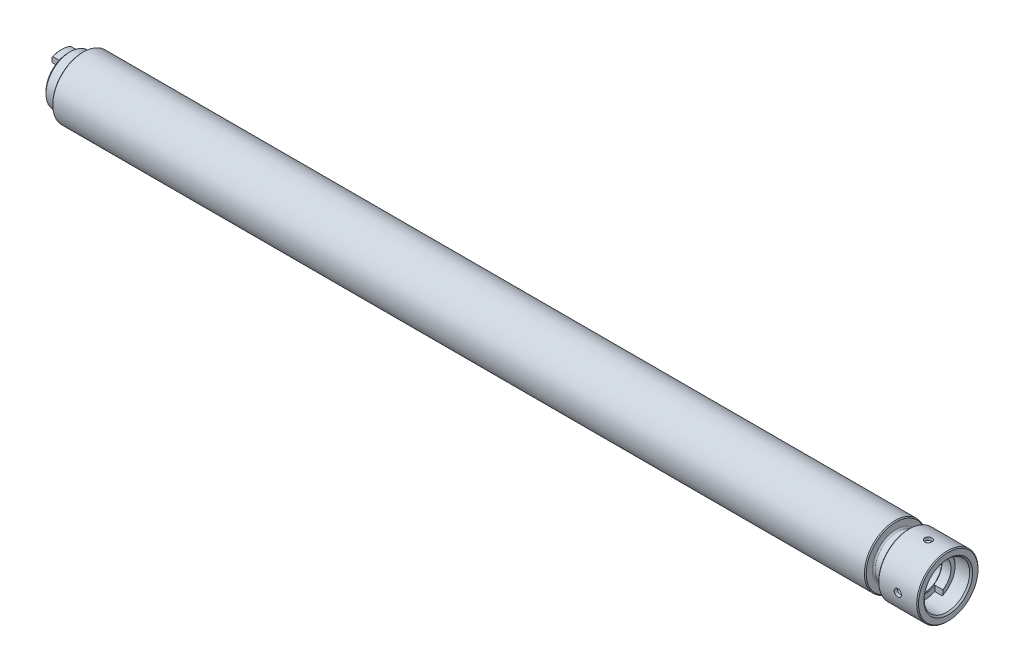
ISO-10303-21;
HEADER;
FILE_DESCRIPTION(('STEP AP214'),'2;1');
FILE_NAME('part.step','',(''),(''),'','','');
FILE_SCHEMA(('AUTOMOTIVE_DESIGN { 1 0 10303 214 1 1 1 1 }'));
ENDSEC;
DATA;
#1=APPLICATION_CONTEXT('core data for automotive mechanical design processes');
#2=APPLICATION_PROTOCOL_DEFINITION('international standard','automotive_design',2000,#1);
#3=PRODUCT_CONTEXT('',#1,'mechanical');
#4=PRODUCT('Part','Part','',(#3));
#5=PRODUCT_RELATED_PRODUCT_CATEGORY('part','',(#4));
#6=PRODUCT_DEFINITION_FORMATION('','',#4);
#7=PRODUCT_DEFINITION_CONTEXT('part definition',#1,'design');
#8=PRODUCT_DEFINITION('design','',#6,#7);
#9=PRODUCT_DEFINITION_SHAPE('','',#8);
#10=(LENGTH_UNIT() NAMED_UNIT(*) SI_UNIT(.MILLI.,.METRE.));
#11=(NAMED_UNIT(*) PLANE_ANGLE_UNIT() SI_UNIT($,.RADIAN.));
#12=(NAMED_UNIT(*) SI_UNIT($,.STERADIAN.) SOLID_ANGLE_UNIT());
#13=UNCERTAINTY_MEASURE_WITH_UNIT(LENGTH_MEASURE(1.E-05),#10,'distance_accuracy_value','');
#14=(GEOMETRIC_REPRESENTATION_CONTEXT(3) GLOBAL_UNCERTAINTY_ASSIGNED_CONTEXT((#13)) GLOBAL_UNIT_ASSIGNED_CONTEXT((#10,
#11,#12)) REPRESENTATION_CONTEXT('',''));
#15=CARTESIAN_POINT('',(0.,0.,0.));
#16=DIRECTION('',(0.,0.,1.));
#17=DIRECTION('',(1.,0.,0.));
#18=AXIS2_PLACEMENT_3D('',#15,#16,#17);
#19=CARTESIAN_POINT('',(480.,0.,0.));
#20=DIRECTION('',(1.,0.,0.));
#21=DIRECTION('',(0.,1.,0.));
#22=AXIS2_PLACEMENT_3D('',#19,#20,#21);
#23=CYLINDRICAL_SURFACE('',#22,17.);
#24=CARTESIAN_POINT('',(458.5,0.,0.));
#25=DIRECTION('',(1.,0.,0.));
#26=DIRECTION('',(0.,1.,0.));
#27=AXIS2_PLACEMENT_3D('',#24,#25,#26);
#28=CIRCLE('',#27,17.);
#29=CARTESIAN_POINT('',(458.5,17.,0.));
#30=VERTEX_POINT('',#29);
#31=EDGE_CURVE('E242',#30,#30,#28,.T.);
#32=ORIENTED_EDGE('',*,*,#31,.T.);
#33=EDGE_LOOP('',(#32));
#34=FACE_BOUND('',#33,.T.);
#35=CARTESIAN_POINT('',(471.,0.,17.));
#36=CARTESIAN_POINT('',(470.99999521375,-0.111926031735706,16.9999985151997));
#37=CARTESIAN_POINT('',(470.990572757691,-0.223923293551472,16.9988829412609));
#38=CARTESIAN_POINT('',(470.953131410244,-0.444804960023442,16.9945399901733));
#39=CARTESIAN_POINT('',(470.925092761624,-0.553685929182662,16.9913103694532));
#40=CARTESIAN_POINT('',(470.85125340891,-0.76510503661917,16.9831033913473));
#41=CARTESIAN_POINT('',(470.805464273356,-0.867647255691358,16.9781271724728));
#42=CARTESIAN_POINT('',(470.69744816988,-1.06357111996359,16.9669813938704));
#43=CARTESIAN_POINT('',(470.635224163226,-1.15695441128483,16.9608120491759));
#44=CARTESIAN_POINT('',(470.495778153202,-1.33238781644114,16.9479357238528));
#45=CARTESIAN_POINT('',(470.418491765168,-1.41438659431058,16.9412265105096));
#46=CARTESIAN_POINT('',(470.251252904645,-1.56428146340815,16.9280447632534));
#47=CARTESIAN_POINT('',(470.16129980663,-1.6321768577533,16.921572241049));
#48=CARTESIAN_POINT('',(469.970950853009,-1.75212620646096,16.9095745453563));
#49=CARTESIAN_POINT('',(469.870524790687,-1.80413253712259,16.9040522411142));
#50=CARTESIAN_POINT('',(469.662288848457,-1.89052338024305,16.8946092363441));
#51=CARTESIAN_POINT('',(469.554479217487,-1.92490848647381,16.8906884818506));
#52=CARTESIAN_POINT('',(469.335066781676,-1.97492589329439,16.8849135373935));
#53=CARTESIAN_POINT('',(469.223483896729,-1.99064446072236,16.8830498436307));
#54=CARTESIAN_POINT('',(468.999249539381,-2.00314945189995,16.881570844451));
#55=CARTESIAN_POINT('',(468.88659810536,-1.99993655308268,16.8819554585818));
#56=CARTESIAN_POINT('',(468.664023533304,-1.97474071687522,16.8849209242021));
#57=CARTESIAN_POINT('',(468.554089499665,-1.95285253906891,16.8874906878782));
#58=CARTESIAN_POINT('',(468.339465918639,-1.89107519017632,16.8945196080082));
#59=CARTESIAN_POINT('',(468.234776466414,-1.85118569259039,16.8989787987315));
#60=CARTESIAN_POINT('',(468.033317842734,-1.75443530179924,16.9092967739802));
#61=CARTESIAN_POINT('',(467.936568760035,-1.6975329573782,16.9151589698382));
#62=CARTESIAN_POINT('',(467.753957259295,-1.56840181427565,16.9276197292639));
#63=CARTESIAN_POINT('',(467.668095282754,-1.49617239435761,16.9342183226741));
#64=CARTESIAN_POINT('',(467.509145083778,-1.33791096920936,16.9474577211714));
#65=CARTESIAN_POINT('',(467.436138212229,-1.25179723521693,16.9540985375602));
#66=CARTESIAN_POINT('',(467.305603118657,-1.06849379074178,16.9666362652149));
#67=CARTESIAN_POINT('',(467.248074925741,-0.971304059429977,16.9725331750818));
#68=CARTESIAN_POINT('',(467.150131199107,-0.768546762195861,16.9829217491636));
#69=CARTESIAN_POINT('',(467.10972045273,-0.662976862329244,16.9874130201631));
#70=CARTESIAN_POINT('',(467.047221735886,-0.446485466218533,16.9944805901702));
#71=CARTESIAN_POINT('',(467.025133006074,-0.335564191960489,16.9970569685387));
#72=CARTESIAN_POINT('',(467.000010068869,-0.11222243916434,16.9999941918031));
#73=CARTESIAN_POINT('',(466.996863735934,0.00018526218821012,17.0003680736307));
#74=CARTESIAN_POINT('',(467.009419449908,0.223926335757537,16.9988933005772));
#75=CARTESIAN_POINT('',(467.025121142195,0.335259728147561,16.997044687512));
#76=CARTESIAN_POINT('',(467.074834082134,0.553363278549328,16.9913408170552));
#77=CARTESIAN_POINT('',(467.108792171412,0.660145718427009,16.9874913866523));
#78=CARTESIAN_POINT('',(467.193998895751,0.866499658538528,16.978217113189));
#79=CARTESIAN_POINT('',(467.245248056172,0.966070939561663,16.9727922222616));
#80=CARTESIAN_POINT('',(467.363855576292,1.15567883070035,16.9609399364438));
#81=CARTESIAN_POINT('',(467.431286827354,1.24566955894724,16.9545080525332));
#82=CARTESIAN_POINT('',(467.580240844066,1.41309578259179,16.9413761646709));
#83=CARTESIAN_POINT('',(467.661764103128,1.49053083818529,16.9346761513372));
#84=CARTESIAN_POINT('',(467.837080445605,1.63104275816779,16.9217232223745));
#85=CARTESIAN_POINT('',(467.930933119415,1.69404552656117,16.9154727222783));
#86=CARTESIAN_POINT('',(468.127953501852,1.80339337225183,16.9041653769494));
#87=CARTESIAN_POINT('',(468.231121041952,1.84973875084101,16.8991085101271));
#88=CARTESIAN_POINT('',(468.443598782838,1.92433498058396,16.8907770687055));
#89=CARTESIAN_POINT('',(468.552893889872,1.95262833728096,16.8874983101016));
#90=CARTESIAN_POINT('',(468.774724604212,1.99045460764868,16.8830820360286));
#91=CARTESIAN_POINT('',(468.887260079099,1.9999882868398,16.8819444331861));
#92=CARTESIAN_POINT('',(469.111640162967,2.00001162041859,16.8819416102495));
#93=CARTESIAN_POINT('',(469.22348477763,1.99061767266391,16.88306250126));
#94=CARTESIAN_POINT('',(469.443994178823,1.95329812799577,16.8874205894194));
#95=CARTESIAN_POINT('',(469.552658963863,1.925372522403,16.8906577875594));
#96=CARTESIAN_POINT('',(469.763713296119,1.8518174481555,16.8988795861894));
#97=CARTESIAN_POINT('',(469.866104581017,1.80619290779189,16.9038637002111));
#98=CARTESIAN_POINT('',(470.061796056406,1.69854661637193,16.9150186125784));
#99=CARTESIAN_POINT('',(470.155096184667,1.63652475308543,16.9211894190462));
#100=CARTESIAN_POINT('',(470.330552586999,1.49741057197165,16.9340679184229));
#101=CARTESIAN_POINT('',(470.412639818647,1.42023144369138,16.9407785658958));
#102=CARTESIAN_POINT('',(470.56274417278,1.25317277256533,16.9539542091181));
#103=CARTESIAN_POINT('',(470.630757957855,1.16329022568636,16.9604191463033));
#104=CARTESIAN_POINT('',(470.750976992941,0.973031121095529,16.9723987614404));
#105=CARTESIAN_POINT('',(470.803127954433,0.872620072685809,16.9779101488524));
#106=CARTESIAN_POINT('',(470.889755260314,0.664459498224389,16.9873277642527));
#107=CARTESIAN_POINT('',(470.924251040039,0.556718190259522,16.9912357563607));
#108=CARTESIAN_POINT('',(470.966221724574,0.373668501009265,16.9960514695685));
#109=CARTESIAN_POINT('',(470.978870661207,0.299519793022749,16.9975250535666));
#110=CARTESIAN_POINT('',(470.995761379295,0.150258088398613,16.9994998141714));
#111=CARTESIAN_POINT('',(471.000003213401,0.0751450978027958,17.0000009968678));
#112=CARTESIAN_POINT('',(471.,0.,17.));
#113=B_SPLINE_CURVE_WITH_KNOTS('',3,(#35,#36,#37,#38,#39,#40,#41,#42,#43,#44,#45,#46,#47,#48,
#49,#50,#51,#52,#53,#54,#55,#56,#57,#58,#59,#60,#61,#62,#63,#64,#65,#66,#67,#68,#69,#70,#71,#72,
#73,#74,#75,#76,#77,#78,#79,#80,#81,#82,#83,#84,#85,#86,#87,#88,#89,#90,#91,#92,#93,#94,#95,#96,
#97,#98,#99,#100,#101,#102,#103,#104,#105,#106,#107,#108,#109,#110,#111,#112),.UNSPECIFIED.,.T.,
.F.,(4,2,2,2,2,2,2,2,2,2,2,2,2,2,2,2,2,2,2,2,2,2,2,2,2,2,2,2,2,2,2,2,2,2,2,2,2,2,4),(0.,
0.335503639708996,0.671363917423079,1.00700567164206,1.34258699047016,1.67963553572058,
2.0167007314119,2.35476650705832,2.69282089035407,3.02930680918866,3.3657806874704,
3.70055735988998,4.03534010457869,4.37094527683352,4.70656405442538,5.04423583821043,
5.38190825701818,5.71967505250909,6.0574278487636,6.39317940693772,6.72892464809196,
7.0636975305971,7.39848058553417,7.73480093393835,8.07113306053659,8.409155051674,
8.7471709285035,9.08438794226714,9.42159119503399,9.75672710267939,10.0918631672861,
10.4269059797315,10.7619510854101,11.0989742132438,11.4360771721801,11.7743211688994,
12.1121920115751,12.3374444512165,12.5626954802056),.UNSPECIFIED.);
#114=CARTESIAN_POINT('',(471.,0.,17.));
#115=VERTEX_POINT('',#114);
#116=EDGE_CURVE('E27',#115,#115,#113,.T.);
#117=ORIENTED_EDGE('',*,*,#116,.T.);
#118=EDGE_LOOP('',(#117));
#119=FACE_BOUND('',#118,.T.);
#120=CARTESIAN_POINT('',(471.,17.,0.));
#121=CARTESIAN_POINT('',(470.99999521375,16.9999985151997,0.111926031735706));
#122=CARTESIAN_POINT('',(470.990572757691,16.9988829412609,0.223923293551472));
#123=CARTESIAN_POINT('',(470.953131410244,16.9945399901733,0.444804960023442));
#124=CARTESIAN_POINT('',(470.925092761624,16.9913103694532,0.553685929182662));
#125=CARTESIAN_POINT('',(470.85125340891,16.9831033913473,0.76510503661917));
#126=CARTESIAN_POINT('',(470.805464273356,16.9781271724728,0.867647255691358));
#127=CARTESIAN_POINT('',(470.69744816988,16.9669813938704,1.06357111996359));
#128=CARTESIAN_POINT('',(470.635224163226,16.9608120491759,1.15695441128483));
#129=CARTESIAN_POINT('',(470.495778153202,16.9479357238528,1.33238781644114));
#130=CARTESIAN_POINT('',(470.418491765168,16.9412265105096,1.41438659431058));
#131=CARTESIAN_POINT('',(470.251252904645,16.9280447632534,1.56428146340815));
#132=CARTESIAN_POINT('',(470.16129980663,16.921572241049,1.6321768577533));
#133=CARTESIAN_POINT('',(469.970950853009,16.9095745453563,1.75212620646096));
#134=CARTESIAN_POINT('',(469.870524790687,16.9040522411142,1.80413253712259));
#135=CARTESIAN_POINT('',(469.662288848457,16.8946092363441,1.89052338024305));
#136=CARTESIAN_POINT('',(469.554479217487,16.8906884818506,1.92490848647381));
#137=CARTESIAN_POINT('',(469.335066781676,16.8849135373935,1.97492589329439));
#138=CARTESIAN_POINT('',(469.223483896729,16.8830498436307,1.99064446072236));
#139=CARTESIAN_POINT('',(468.999249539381,16.881570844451,2.00314945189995));
#140=CARTESIAN_POINT('',(468.88659810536,16.8819554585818,1.99993655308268));
#141=CARTESIAN_POINT('',(468.664023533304,16.8849209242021,1.97474071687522));
#142=CARTESIAN_POINT('',(468.554089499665,16.8874906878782,1.95285253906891));
#143=CARTESIAN_POINT('',(468.339465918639,16.8945196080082,1.89107519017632));
#144=CARTESIAN_POINT('',(468.234776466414,16.8989787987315,1.85118569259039));
#145=CARTESIAN_POINT('',(468.033317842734,16.9092967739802,1.75443530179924));
#146=CARTESIAN_POINT('',(467.936568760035,16.9151589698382,1.6975329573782));
#147=CARTESIAN_POINT('',(467.753957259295,16.9276197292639,1.56840181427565));
#148=CARTESIAN_POINT('',(467.668095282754,16.9342183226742,1.49617239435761));
#149=CARTESIAN_POINT('',(467.509145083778,16.9474577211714,1.33791096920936));
#150=CARTESIAN_POINT('',(467.436138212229,16.9540985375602,1.25179723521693));
#151=CARTESIAN_POINT('',(467.305603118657,16.9666362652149,1.06849379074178));
#152=CARTESIAN_POINT('',(467.248074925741,16.9725331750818,0.971304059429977));
#153=CARTESIAN_POINT('',(467.150131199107,16.9829217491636,0.768546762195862));
#154=CARTESIAN_POINT('',(467.10972045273,16.9874130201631,0.662976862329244));
#155=CARTESIAN_POINT('',(467.047221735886,16.9944805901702,0.446485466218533));
#156=CARTESIAN_POINT('',(467.025133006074,16.9970569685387,0.335564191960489));
#157=CARTESIAN_POINT('',(467.000010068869,16.9999941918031,0.11222243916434));
#158=CARTESIAN_POINT('',(466.996863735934,17.0003680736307,-0.00018526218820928));
#159=CARTESIAN_POINT('',(467.009419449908,16.9988933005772,-0.223926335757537));
#160=CARTESIAN_POINT('',(467.025121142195,16.997044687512,-0.33525972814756));
#161=CARTESIAN_POINT('',(467.074834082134,16.9913408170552,-0.553363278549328));
#162=CARTESIAN_POINT('',(467.108792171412,16.9874913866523,-0.660145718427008));
#163=CARTESIAN_POINT('',(467.193998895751,16.978217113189,-0.866499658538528));
#164=CARTESIAN_POINT('',(467.245248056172,16.9727922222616,-0.966070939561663));
#165=CARTESIAN_POINT('',(467.363855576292,16.9609399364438,-1.15567883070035));
#166=CARTESIAN_POINT('',(467.431286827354,16.9545080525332,-1.24566955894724));
#167=CARTESIAN_POINT('',(467.580240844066,16.9413761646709,-1.41309578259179));
#168=CARTESIAN_POINT('',(467.661764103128,16.9346761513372,-1.49053083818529));
#169=CARTESIAN_POINT('',(467.837080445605,16.9217232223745,-1.63104275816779));
#170=CARTESIAN_POINT('',(467.930933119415,16.9154727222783,-1.69404552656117));
#171=CARTESIAN_POINT('',(468.127953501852,16.9041653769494,-1.80339337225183));
#172=CARTESIAN_POINT('',(468.231121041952,16.8991085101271,-1.84973875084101));
#173=CARTESIAN_POINT('',(468.443598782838,16.8907770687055,-1.92433498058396));
#174=CARTESIAN_POINT('',(468.552893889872,16.8874983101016,-1.95262833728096));
#175=CARTESIAN_POINT('',(468.774724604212,16.8830820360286,-1.99045460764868));
#176=CARTESIAN_POINT('',(468.887260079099,16.8819444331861,-1.9999882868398));
#177=CARTESIAN_POINT('',(469.111640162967,16.8819416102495,-2.00001162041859));
#178=CARTESIAN_POINT('',(469.22348477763,16.88306250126,-1.99061767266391));
#179=CARTESIAN_POINT('',(469.443994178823,16.8874205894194,-1.95329812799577));
#180=CARTESIAN_POINT('',(469.552658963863,16.8906577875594,-1.925372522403));
#181=CARTESIAN_POINT('',(469.763713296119,16.8988795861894,-1.8518174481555));
#182=CARTESIAN_POINT('',(469.866104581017,16.9038637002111,-1.80619290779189));
#183=CARTESIAN_POINT('',(470.061796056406,16.9150186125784,-1.69854661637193));
#184=CARTESIAN_POINT('',(470.155096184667,16.9211894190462,-1.63652475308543));
#185=CARTESIAN_POINT('',(470.330552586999,16.9340679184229,-1.49741057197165));
#186=CARTESIAN_POINT('',(470.412639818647,16.9407785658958,-1.42023144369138));
#187=CARTESIAN_POINT('',(470.56274417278,16.9539542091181,-1.25317277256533));
#188=CARTESIAN_POINT('',(470.630757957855,16.9604191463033,-1.16329022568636));
#189=CARTESIAN_POINT('',(470.750976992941,16.9723987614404,-0.973031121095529));
#190=CARTESIAN_POINT('',(470.803127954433,16.9779101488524,-0.872620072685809));
#191=CARTESIAN_POINT('',(470.889755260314,16.9873277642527,-0.664459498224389));
#192=CARTESIAN_POINT('',(470.924251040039,16.9912357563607,-0.556718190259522));
#193=CARTESIAN_POINT('',(470.966221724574,16.9960514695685,-0.373668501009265));
#194=CARTESIAN_POINT('',(470.978870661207,16.9975250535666,-0.299519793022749));
#195=CARTESIAN_POINT('',(470.995761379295,16.9994998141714,-0.150258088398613));
#196=CARTESIAN_POINT('',(471.000003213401,17.0000009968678,-0.0751450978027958));
#197=CARTESIAN_POINT('',(471.,17.,0.));
#198=B_SPLINE_CURVE_WITH_KNOTS('',3,(#120,#121,#122,#123,#124,#125,#126,#127,#128,#129,#130,
#131,#132,#133,#134,#135,#136,#137,#138,#139,#140,#141,#142,#143,#144,#145,#146,#147,#148,#149,
#150,#151,#152,#153,#154,#155,#156,#157,#158,#159,#160,#161,#162,#163,#164,#165,#166,#167,#168,
#169,#170,#171,#172,#173,#174,#175,#176,#177,#178,#179,#180,#181,#182,#183,#184,#185,#186,#187,
#188,#189,#190,#191,#192,#193,#194,#195,#196,#197),.UNSPECIFIED.,.T.,.F.,(4,2,2,2,2,2,2,2,2,2,2,
2,2,2,2,2,2,2,2,2,2,2,2,2,2,2,2,2,2,2,2,2,2,2,2,2,2,2,4),(0.,0.335503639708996,
0.671363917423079,1.00700567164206,1.34258699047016,1.67963553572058,2.0167007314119,
2.35476650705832,2.69282089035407,3.02930680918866,3.3657806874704,3.70055735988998,
4.03534010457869,4.37094527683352,4.70656405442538,5.04423583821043,5.38190825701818,
5.71967505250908,6.0574278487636,6.39317940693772,6.72892464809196,7.0636975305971,
7.39848058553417,7.73480093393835,8.07113306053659,8.409155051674,8.7471709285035,
9.08438794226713,9.42159119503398,9.75672710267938,10.0918631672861,10.4269059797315,
10.7619510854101,11.0989742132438,11.4360771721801,11.7743211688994,12.1121920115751,
12.3374444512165,12.5626954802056),.UNSPECIFIED.);
#199=CARTESIAN_POINT('',(471.,17.,0.));
#200=VERTEX_POINT('',#199);
#201=EDGE_CURVE('E203',#200,#200,#198,.T.);
#202=ORIENTED_EDGE('',*,*,#201,.T.);
#203=EDGE_LOOP('',(#202));
#204=FACE_BOUND('',#203,.T.);
#205=CARTESIAN_POINT('',(471.,-17.,0.));
#206=CARTESIAN_POINT('',(470.99999521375,-16.9999985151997,-0.111926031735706));
#207=CARTESIAN_POINT('',(470.990572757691,-16.9988829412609,-0.223923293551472));
#208=CARTESIAN_POINT('',(470.953131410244,-16.9945399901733,-0.444804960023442));
#209=CARTESIAN_POINT('',(470.925092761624,-16.9913103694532,-0.553685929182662));
#210=CARTESIAN_POINT('',(470.85125340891,-16.9831033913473,-0.76510503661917));
#211=CARTESIAN_POINT('',(470.805464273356,-16.9781271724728,-0.867647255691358));
#212=CARTESIAN_POINT('',(470.69744816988,-16.9669813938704,-1.06357111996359));
#213=CARTESIAN_POINT('',(470.635224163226,-16.9608120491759,-1.15695441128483));
#214=CARTESIAN_POINT('',(470.495778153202,-16.9479357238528,-1.33238781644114));
#215=CARTESIAN_POINT('',(470.418491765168,-16.9412265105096,-1.41438659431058));
#216=CARTESIAN_POINT('',(470.251252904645,-16.9280447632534,-1.56428146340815));
#217=CARTESIAN_POINT('',(470.16129980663,-16.921572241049,-1.6321768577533));
#218=CARTESIAN_POINT('',(469.970950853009,-16.9095745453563,-1.75212620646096));
#219=CARTESIAN_POINT('',(469.870524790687,-16.9040522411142,-1.80413253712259));
#220=CARTESIAN_POINT('',(469.662288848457,-16.8946092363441,-1.89052338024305));
#221=CARTESIAN_POINT('',(469.554479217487,-16.8906884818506,-1.92490848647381));
#222=CARTESIAN_POINT('',(469.335066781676,-16.8849135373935,-1.97492589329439));
#223=CARTESIAN_POINT('',(469.223483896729,-16.8830498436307,-1.99064446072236));
#224=CARTESIAN_POINT('',(468.999249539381,-16.881570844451,-2.00314945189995));
#225=CARTESIAN_POINT('',(468.88659810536,-16.8819554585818,-1.99993655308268));
#226=CARTESIAN_POINT('',(468.664023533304,-16.8849209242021,-1.97474071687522));
#227=CARTESIAN_POINT('',(468.554089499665,-16.8874906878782,-1.95285253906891));
#228=CARTESIAN_POINT('',(468.339465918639,-16.8945196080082,-1.89107519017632));
#229=CARTESIAN_POINT('',(468.234776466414,-16.8989787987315,-1.85118569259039));
#230=CARTESIAN_POINT('',(468.033317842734,-16.9092967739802,-1.75443530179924));
#231=CARTESIAN_POINT('',(467.936568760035,-16.9151589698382,-1.6975329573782));
#232=CARTESIAN_POINT('',(467.753957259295,-16.9276197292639,-1.56840181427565));
#233=CARTESIAN_POINT('',(467.668095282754,-16.9342183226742,-1.49617239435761));
#234=CARTESIAN_POINT('',(467.509145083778,-16.9474577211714,-1.33791096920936));
#235=CARTESIAN_POINT('',(467.436138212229,-16.9540985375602,-1.25179723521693));
#236=CARTESIAN_POINT('',(467.305603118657,-16.9666362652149,-1.06849379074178));
#237=CARTESIAN_POINT('',(467.248074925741,-16.9725331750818,-0.971304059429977));
#238=CARTESIAN_POINT('',(467.150131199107,-16.9829217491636,-0.768546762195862));
#239=CARTESIAN_POINT('',(467.10972045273,-16.9874130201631,-0.662976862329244));
#240=CARTESIAN_POINT('',(467.047221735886,-16.9944805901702,-0.446485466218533));
#241=CARTESIAN_POINT('',(467.025133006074,-16.9970569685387,-0.335564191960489));
#242=CARTESIAN_POINT('',(467.000010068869,-16.9999941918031,-0.11222243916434));
#243=CARTESIAN_POINT('',(466.996863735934,-17.0003680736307,0.00018526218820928));
#244=CARTESIAN_POINT('',(467.009419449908,-16.9988933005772,0.223926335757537));
#245=CARTESIAN_POINT('',(467.025121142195,-16.997044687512,0.33525972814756));
#246=CARTESIAN_POINT('',(467.074834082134,-16.9913408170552,0.553363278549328));
#247=CARTESIAN_POINT('',(467.108792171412,-16.9874913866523,0.660145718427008));
#248=CARTESIAN_POINT('',(467.193998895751,-16.978217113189,0.866499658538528));
#249=CARTESIAN_POINT('',(467.245248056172,-16.9727922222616,0.966070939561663));
#250=CARTESIAN_POINT('',(467.363855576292,-16.9609399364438,1.15567883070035));
#251=CARTESIAN_POINT('',(467.431286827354,-16.9545080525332,1.24566955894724));
#252=CARTESIAN_POINT('',(467.580240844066,-16.9413761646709,1.41309578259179));
#253=CARTESIAN_POINT('',(467.661764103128,-16.9346761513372,1.49053083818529));
#254=CARTESIAN_POINT('',(467.837080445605,-16.9217232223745,1.63104275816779));
#255=CARTESIAN_POINT('',(467.930933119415,-16.9154727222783,1.69404552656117));
#256=CARTESIAN_POINT('',(468.127953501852,-16.9041653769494,1.80339337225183));
#257=CARTESIAN_POINT('',(468.231121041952,-16.8991085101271,1.84973875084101));
#258=CARTESIAN_POINT('',(468.443598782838,-16.8907770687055,1.92433498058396));
#259=CARTESIAN_POINT('',(468.552893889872,-16.8874983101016,1.95262833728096));
#260=CARTESIAN_POINT('',(468.774724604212,-16.8830820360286,1.99045460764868));
#261=CARTESIAN_POINT('',(468.887260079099,-16.8819444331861,1.9999882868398));
#262=CARTESIAN_POINT('',(469.111640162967,-16.8819416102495,2.00001162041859));
#263=CARTESIAN_POINT('',(469.22348477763,-16.88306250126,1.99061767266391));
#264=CARTESIAN_POINT('',(469.443994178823,-16.8874205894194,1.95329812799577));
#265=CARTESIAN_POINT('',(469.552658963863,-16.8906577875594,1.925372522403));
#266=CARTESIAN_POINT('',(469.763713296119,-16.8988795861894,1.8518174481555));
#267=CARTESIAN_POINT('',(469.866104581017,-16.9038637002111,1.80619290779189));
#268=CARTESIAN_POINT('',(470.061796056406,-16.9150186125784,1.69854661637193));
#269=CARTESIAN_POINT('',(470.155096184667,-16.9211894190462,1.63652475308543));
#270=CARTESIAN_POINT('',(470.330552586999,-16.9340679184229,1.49741057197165));
#271=CARTESIAN_POINT('',(470.412639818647,-16.9407785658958,1.42023144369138));
#272=CARTESIAN_POINT('',(470.56274417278,-16.9539542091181,1.25317277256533));
#273=CARTESIAN_POINT('',(470.630757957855,-16.9604191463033,1.16329022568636));
#274=CARTESIAN_POINT('',(470.750976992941,-16.9723987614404,0.973031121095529));
#275=CARTESIAN_POINT('',(470.803127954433,-16.9779101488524,0.872620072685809));
#276=CARTESIAN_POINT('',(470.889755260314,-16.9873277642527,0.664459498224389));
#277=CARTESIAN_POINT('',(470.924251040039,-16.9912357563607,0.556718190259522));
#278=CARTESIAN_POINT('',(470.966221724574,-16.9960514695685,0.373668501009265));
#279=CARTESIAN_POINT('',(470.978870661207,-16.9975250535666,0.299519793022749));
#280=CARTESIAN_POINT('',(470.995761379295,-16.9994998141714,0.150258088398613));
#281=CARTESIAN_POINT('',(471.000003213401,-17.0000009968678,0.0751450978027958));
#282=CARTESIAN_POINT('',(471.,-17.,0.));
#283=B_SPLINE_CURVE_WITH_KNOTS('',3,(#205,#206,#207,#208,#209,#210,#211,#212,#213,#214,#215,
#216,#217,#218,#219,#220,#221,#222,#223,#224,#225,#226,#227,#228,#229,#230,#231,#232,#233,#234,
#235,#236,#237,#238,#239,#240,#241,#242,#243,#244,#245,#246,#247,#248,#249,#250,#251,#252,#253,
#254,#255,#256,#257,#258,#259,#260,#261,#262,#263,#264,#265,#266,#267,#268,#269,#270,#271,#272,
#273,#274,#275,#276,#277,#278,#279,#280,#281,#282),.UNSPECIFIED.,.T.,.F.,(4,2,2,2,2,2,2,2,2,2,2,
2,2,2,2,2,2,2,2,2,2,2,2,2,2,2,2,2,2,2,2,2,2,2,2,2,2,2,4),(0.,0.335503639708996,
0.671363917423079,1.00700567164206,1.34258699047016,1.67963553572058,2.0167007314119,
2.35476650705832,2.69282089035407,3.02930680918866,3.3657806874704,3.70055735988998,
4.03534010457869,4.37094527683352,4.70656405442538,5.04423583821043,5.38190825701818,
5.71967505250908,6.0574278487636,6.39317940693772,6.72892464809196,7.0636975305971,
7.39848058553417,7.73480093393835,8.07113306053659,8.409155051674,8.7471709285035,
9.08438794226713,9.42159119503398,9.75672710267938,10.0918631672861,10.4269059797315,
10.7619510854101,11.0989742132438,11.4360771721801,11.7743211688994,12.1121920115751,
12.3374444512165,12.5626954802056),.UNSPECIFIED.);
#284=CARTESIAN_POINT('',(471.,-17.,0.));
#285=VERTEX_POINT('',#284);
#286=EDGE_CURVE('E210',#285,#285,#283,.T.);
#287=ORIENTED_EDGE('',*,*,#286,.T.);
#288=EDGE_LOOP('',(#287));
#289=FACE_BOUND('',#288,.T.);
#290=CARTESIAN_POINT('',(479.5,0.,0.));
#291=DIRECTION('',(1.,0.,0.));
#292=DIRECTION('',(0.,1.,0.));
#293=AXIS2_PLACEMENT_3D('',#290,#291,#292);
#294=CIRCLE('',#293,17.);
#295=CARTESIAN_POINT('',(479.5,17.,0.));
#296=VERTEX_POINT('',#295);
#297=EDGE_CURVE('E245',#296,#296,#294,.T.);
#298=ORIENTED_EDGE('',*,*,#297,.F.);
#299=EDGE_LOOP('',(#298));
#300=FACE_BOUND('',#299,.T.);
#301=CARTESIAN_POINT('',(469.,2.,-16.8819430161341));
#302=CARTESIAN_POINT('',(468.888076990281,1.99999521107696,-16.8819445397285));
#303=CARTESIAN_POINT('',(468.776082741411,1.99057324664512,-16.8830680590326));
#304=CARTESIAN_POINT('',(468.55520733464,1.95313402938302,-16.8874393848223));
#305=CARTESIAN_POINT('',(468.446329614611,1.92509700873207,-16.8906894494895));
#306=CARTESIAN_POINT('',(468.234917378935,1.85126241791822,-16.898940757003));
#307=CARTESIAN_POINT('',(468.132378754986,1.80547649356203,-16.9039408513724));
#308=CARTESIAN_POINT('',(467.936460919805,1.69746795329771,-16.9151274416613));
#309=CARTESIAN_POINT('',(467.843080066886,1.63524829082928,-16.9213137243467));
#310=CARTESIAN_POINT('',(467.667643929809,1.49580667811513,-16.9342101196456));
#311=CARTESIAN_POINT('',(467.585640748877,1.41851937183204,-16.9409224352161));
#312=CARTESIAN_POINT('',(467.435737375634,1.25127682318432,-16.9540947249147));
#313=CARTESIAN_POINT('',(467.367837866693,1.16132096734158,-16.9605546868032));
#314=CARTESIAN_POINT('',(467.247884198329,0.97096957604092,-16.972516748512));
#315=CARTESIAN_POINT('',(467.195876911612,0.870544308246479,-16.9780159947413));
#316=CARTESIAN_POINT('',(467.109484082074,0.662310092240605,-16.9874128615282));
#317=CARTESIAN_POINT('',(467.075097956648,0.554501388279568,-16.9913105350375));
#318=CARTESIAN_POINT('',(467.025078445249,0.335091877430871,-16.9970495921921));
#319=CARTESIAN_POINT('',(467.009358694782,0.22351101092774,-16.9989004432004));
#320=CARTESIAN_POINT('',(466.996850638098,-0.000719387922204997,-17.0003696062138));
#321=CARTESIAN_POINT('',(467.000061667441,-0.113368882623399,-16.9999879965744));
#322=CARTESIAN_POINT('',(467.025254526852,-0.335951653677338,-16.9970429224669));
#323=CARTESIAN_POINT('',(467.047143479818,-0.445895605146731,-16.9944902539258));
#324=CARTESIAN_POINT('',(467.10892581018,-0.660538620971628,-16.9875020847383));
#325=CARTESIAN_POINT('',(467.148819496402,-0.765237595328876,-16.9830665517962));
#326=CARTESIAN_POINT('',(467.245578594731,-0.96670782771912,-16.972792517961));
#327=CARTESIAN_POINT('',(467.302484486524,-1.06345946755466,-16.9669506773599));
#328=CARTESIAN_POINT('',(467.43162321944,-1.24607458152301,-16.9545182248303));
#329=CARTESIAN_POINT('',(467.503856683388,-1.33193761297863,-16.9479275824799));
#330=CARTESIAN_POINT('',(467.662120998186,-1.49088330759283,-16.9346886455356));
#331=CARTESIAN_POINT('',(467.748232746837,-1.56388543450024,-16.9280402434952));
#332=CARTESIAN_POINT('',(467.931530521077,-1.69441189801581,-16.915474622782));
#333=CARTESIAN_POINT('',(468.028716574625,-1.75193619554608,-16.9095574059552));
#334=CARTESIAN_POINT('',(468.231472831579,-1.84987711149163,-16.8991240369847));
#335=CARTESIAN_POINT('',(468.337045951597,-1.89028774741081,-16.8946083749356));
#336=CARTESIAN_POINT('',(468.553544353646,-1.95278525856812,-16.8874991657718));
#337=CARTESIAN_POINT('',(468.664469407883,-1.97487291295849,-16.8849055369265));
#338=CARTESIAN_POINT('',(468.887812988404,-1.9999917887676,-16.8819487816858));
#339=CARTESIAN_POINT('',(469.000218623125,-2.00313613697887,-16.8815724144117));
#340=CARTESIAN_POINT('',(469.223955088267,-1.99057719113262,-16.8830578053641));
#341=CARTESIAN_POINT('',(469.335285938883,-1.97487425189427,-16.8849195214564));
#342=CARTESIAN_POINT('',(469.553376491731,-1.92516154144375,-16.8906592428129));
#343=CARTESIAN_POINT('',(469.660148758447,-1.89120613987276,-16.8945312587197));
#344=CARTESIAN_POINT('',(469.866483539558,-1.80600819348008,-16.9038504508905));
#345=CARTESIAN_POINT('',(469.966045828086,-1.75476510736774,-16.9092976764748));
#346=CARTESIAN_POINT('',(470.155647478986,-1.63616659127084,-16.9211853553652));
#347=CARTESIAN_POINT('',(470.245639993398,-1.56873672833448,-16.9276303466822));
#348=CARTESIAN_POINT('',(470.413070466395,-1.41978442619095,-16.9407729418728));
#349=CARTESIAN_POINT('',(470.490507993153,-1.33826150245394,-16.9474705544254));
#350=CARTESIAN_POINT('',(470.631025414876,-1.16294410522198,-16.9604042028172));
#351=CARTESIAN_POINT('',(470.694031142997,-1.06908997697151,-16.9666377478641));
#352=CARTESIAN_POINT('',(470.80338417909,-0.872065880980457,-16.9779039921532));
#353=CARTESIAN_POINT('',(470.849731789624,-0.768896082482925,-16.9829367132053));
#354=CARTESIAN_POINT('',(470.924329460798,-0.556419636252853,-16.9912231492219));
#355=CARTESIAN_POINT('',(470.952622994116,-0.447128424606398,-16.9944811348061));
#356=CARTESIAN_POINT('',(470.990450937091,-0.225305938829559,-16.9988686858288));
#357=CARTESIAN_POINT('',(470.999986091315,-0.112774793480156,-16.9999983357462));
#358=CARTESIAN_POINT('',(471.000013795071,0.111607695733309,-17.0000016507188));
#359=CARTESIAN_POINT('',(470.990620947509,0.223459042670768,-16.9988888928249));
#360=CARTESIAN_POINT('',(470.953301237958,0.443982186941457,-16.9945593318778));
#361=CARTESIAN_POINT('',(470.925374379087,0.552653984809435,-16.9913425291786));
#362=CARTESIAN_POINT('',(470.851814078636,0.763722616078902,-16.9831648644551));
#363=CARTESIAN_POINT('',(470.806185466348,0.866121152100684,-16.9782044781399));
#364=CARTESIAN_POINT('',(470.698528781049,1.06182543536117,-16.9670900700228));
#365=CARTESIAN_POINT('',(470.636500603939,1.15513112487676,-16.9609360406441));
#366=CARTESIAN_POINT('',(470.497379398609,1.33058739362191,-16.9480775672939));
#367=CARTESIAN_POINT('',(470.420201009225,1.41267007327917,-16.9413701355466));
#368=CARTESIAN_POINT('',(470.253145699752,1.56276558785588,-16.9281852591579));
#369=CARTESIAN_POINT('',(470.163265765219,1.6307750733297,-16.9217078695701));
#370=CARTESIAN_POINT('',(469.973008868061,1.75098938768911,-16.9096927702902));
#371=CARTESIAN_POINT('',(469.872596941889,1.8031391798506,-16.9041583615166));
#372=CARTESIAN_POINT('',(469.664434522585,1.88976405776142,-16.8946946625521));
#373=CARTESIAN_POINT('',(469.556692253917,1.92425859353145,-16.8907636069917));
#374=CARTESIAN_POINT('',(469.373645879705,1.96622583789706,-16.8859179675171));
#375=CARTESIAN_POINT('',(469.299501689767,1.97887322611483,-16.8844346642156));
#376=CARTESIAN_POINT('',(469.150249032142,1.99576188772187,-16.8824466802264));
#377=CARTESIAN_POINT('',(469.075140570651,2.00000321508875,-16.8819419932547));
#378=CARTESIAN_POINT('',(469.,2.,-16.8819430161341));
#379=B_SPLINE_CURVE_WITH_KNOTS('',3,(#301,#302,#303,#304,#305,#306,#307,#308,#309,#310,#311,
#312,#313,#314,#315,#316,#317,#318,#319,#320,#321,#322,#323,#324,#325,#326,#327,#328,#329,#330,
#331,#332,#333,#334,#335,#336,#337,#338,#339,#340,#341,#342,#343,#344,#345,#346,#347,#348,#349,
#350,#351,#352,#353,#354,#355,#356,#357,#358,#359,#360,#361,#362,#363,#364,#365,#366,#367,#368,
#369,#370,#371,#372,#373,#374,#375,#376,#377,#378),.UNSPECIFIED.,.T.,.F.,(4,2,2,2,2,2,2,2,2,2,2,
2,2,2,2,2,2,2,2,2,2,2,2,2,2,2,2,2,2,2,2,2,2,2,2,2,2,2,4),(0.,0.335494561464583,0.67134596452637,
1.00697737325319,1.34254850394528,1.67960893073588,2.01668568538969,2.35474723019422,
2.69279759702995,3.02927772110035,3.36574603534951,3.7005509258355,4.03536155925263,
4.37097528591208,4.70660265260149,5.04426231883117,5.38192283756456,5.71970129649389,
6.05746539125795,6.39321039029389,6.7289490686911,7.06369316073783,7.39844773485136,
7.73477216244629,8.07110815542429,8.40913566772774,8.74715704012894,9.08436138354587,
9.42155234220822,9.75670785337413,10.0918633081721,10.4269273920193,10.7619936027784,
11.0990048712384,11.4360962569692,11.7743444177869,12.1122191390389,12.3374580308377,
12.5626954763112),.UNSPECIFIED.);
#380=CARTESIAN_POINT('',(469.,2.,-16.8819430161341));
#381=VERTEX_POINT('',#380);
#382=EDGE_CURVE('E9',#381,#381,#379,.T.);
#383=ORIENTED_EDGE('',*,*,#382,.T.);
#384=EDGE_LOOP('',(#383));
#385=FACE_BOUND('',#384,.T.);
#386=ADVANCED_FACE('F14',(#34,#119,#204,#289,#300,#385),#23,.T.);
#387=CARTESIAN_POINT('',(-12.,0.,11.75));
#388=DIRECTION('',(-1.,0.,0.));
#389=DIRECTION('',(0.,-1.,0.));
#390=AXIS2_PLACEMENT_3D('',#387,#388,#389);
#391=PLANE('',#390);
#392=DIRECTION('',(0.,-1.,0.));
#393=VECTOR('',#392,1.);
#394=CARTESIAN_POINT('',(-12.,12.5,4.95));
#395=LINE('',#394,#393);
#396=CARTESIAN_POINT('',(-12.,-8.10848321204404,4.95));
#397=VERTEX_POINT('',#396);
#398=CARTESIAN_POINT('',(-12.,-10.6564534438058,4.95));
#399=VERTEX_POINT('',#398);
#400=EDGE_CURVE('E42',#397,#399,#395,.T.);
#401=ORIENTED_EDGE('',*,*,#400,.F.);
#402=CARTESIAN_POINT('',(-12.,0.,0.));
#403=DIRECTION('',(1.,0.,0.));
#404=DIRECTION('',(0.,1.,0.));
#405=AXIS2_PLACEMENT_3D('',#402,#403,#404);
#406=CIRCLE('',#405,9.5);
#407=CARTESIAN_POINT('',(-12.,-8.10848321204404,-4.95));
#408=VERTEX_POINT('',#407);
#409=EDGE_CURVE('E449',#397,#408,#406,.T.);
#410=ORIENTED_EDGE('',*,*,#409,.T.);
#411=DIRECTION('',(0.,1.,0.));
#412=VECTOR('',#411,1.);
#413=CARTESIAN_POINT('',(-12.,-12.5,-4.95));
#414=LINE('',#413,#412);
#415=CARTESIAN_POINT('',(-12.,-10.6564534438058,-4.95));
#416=VERTEX_POINT('',#415);
#417=EDGE_CURVE('E285',#416,#408,#414,.T.);
#418=ORIENTED_EDGE('',*,*,#417,.F.);
#419=CARTESIAN_POINT('',(-12.,0.,0.));
#420=DIRECTION('',(1.,0.,0.));
#421=DIRECTION('',(0.,1.,0.));
#422=AXIS2_PLACEMENT_3D('',#419,#420,#421);
#423=CIRCLE('',#422,11.75);
#424=EDGE_CURVE('E375',#399,#416,#423,.T.);
#425=ORIENTED_EDGE('',*,*,#424,.F.);
#426=EDGE_LOOP('',(#401,#410,#418,#425));
#427=FACE_BOUND('',#426,.T.);
#428=ADVANCED_FACE('F183',(#427),#391,.T.);
#429=CARTESIAN_POINT('',(472.,0.,0.));
#430=DIRECTION('',(1.,0.,0.));
#431=DIRECTION('',(0.,1.,0.));
#432=AXIS2_PLACEMENT_3D('',#429,#430,#431);
#433=CYLINDRICAL_SURFACE('',#432,9.5);
#434=DIRECTION('',(1.,0.,0.));
#435=VECTOR('',#434,1.);
#436=CARTESIAN_POINT('',(472.,-8.10848321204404,4.95));
#437=LINE('',#436,#435);
#438=CARTESIAN_POINT('',(-8.,-8.10848321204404,4.95));
#439=VERTEX_POINT('',#438);
#440=EDGE_CURVE('E299',#439,#397,#437,.F.);
#441=ORIENTED_EDGE('',*,*,#440,.F.);
#442=CARTESIAN_POINT('',(-8.,0.,0.));
#443=DIRECTION('',(1.,0.,0.));
#444=DIRECTION('',(0.,1.,0.));
#445=AXIS2_PLACEMENT_3D('',#442,#443,#444);
#446=CIRCLE('',#445,9.5);
#447=CARTESIAN_POINT('',(-8.,-8.10848321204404,-4.95));
#448=VERTEX_POINT('',#447);
#449=EDGE_CURVE('E445',#439,#448,#446,.T.);
#450=ORIENTED_EDGE('',*,*,#449,.T.);
#451=DIRECTION('',(1.,0.,0.));
#452=VECTOR('',#451,1.);
#453=CARTESIAN_POINT('',(472.,-8.10848321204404,-4.95));
#454=LINE('',#453,#452);
#455=EDGE_CURVE('E293',#408,#448,#454,.T.);
#456=ORIENTED_EDGE('',*,*,#455,.F.);
#457=ORIENTED_EDGE('',*,*,#409,.F.);
#458=EDGE_LOOP('',(#441,#450,#456,#457));
#459=FACE_BOUND('',#458,.T.);
#460=ADVANCED_FACE('F188',(#459),#433,.F.);
#461=CARTESIAN_POINT('',(472.,0.,0.));
#462=DIRECTION('',(1.,0.,0.));
#463=DIRECTION('',(0.,1.,0.));
#464=AXIS2_PLACEMENT_3D('',#461,#462,#463);
#465=CYLINDRICAL_SURFACE('',#464,12.25);
#466=DIRECTION('',(1.,0.,0.));
#467=VECTOR('',#466,1.);
#468=CARTESIAN_POINT('',(472.,-11.2053558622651,4.95));
#469=LINE('',#468,#467);
#470=CARTESIAN_POINT('',(-11.5,-11.2053558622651,4.95));
#471=VERTEX_POINT('',#470);
#472=CARTESIAN_POINT('',(-8.,-11.2053558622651,4.95));
#473=VERTEX_POINT('',#472);
#474=EDGE_CURVE('E295',#471,#473,#469,.T.);
#475=ORIENTED_EDGE('',*,*,#474,.F.);
#476=CARTESIAN_POINT('',(-11.5,0.,0.));
#477=DIRECTION('',(1.,0.,0.));
#478=DIRECTION('',(0.,1.,0.));
#479=AXIS2_PLACEMENT_3D('',#476,#477,#478);
#480=CIRCLE('',#479,12.25);
#481=CARTESIAN_POINT('',(-11.5,-11.2053558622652,-4.95));
#482=VERTEX_POINT('',#481);
#483=EDGE_CURVE('E379',#471,#482,#480,.T.);
#484=ORIENTED_EDGE('',*,*,#483,.T.);
#485=DIRECTION('',(1.,0.,0.));
#486=VECTOR('',#485,1.);
#487=CARTESIAN_POINT('',(472.,-11.2053558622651,-4.95));
#488=LINE('',#487,#486);
#489=CARTESIAN_POINT('',(-8.,-11.2053558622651,-4.95));
#490=VERTEX_POINT('',#489);
#491=EDGE_CURVE('E289',#490,#482,#488,.F.);
#492=ORIENTED_EDGE('',*,*,#491,.F.);
#493=CARTESIAN_POINT('',(-8.,0.,0.));
#494=DIRECTION('',(1.,0.,0.));
#495=DIRECTION('',(0.,1.,0.));
#496=AXIS2_PLACEMENT_3D('',#493,#494,#495);
#497=CIRCLE('',#496,12.25);
#498=EDGE_CURVE('E384',#473,#490,#497,.T.);
#499=ORIENTED_EDGE('',*,*,#498,.F.);
#500=EDGE_LOOP('',(#475,#484,#492,#499));
#501=FACE_BOUND('',#500,.T.);
#502=ADVANCED_FACE('F490',(#501),#465,.T.);
#503=CARTESIAN_POINT('',(-11.5,0.,0.));
#504=DIRECTION('',(1.,0.,0.));
#505=DIRECTION('',(0.,1.,0.));
#506=AXIS2_PLACEMENT_3D('',#503,#504,#505);
#507=CONICAL_SURFACE('',#506,12.25,0.785398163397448);
#508=CARTESIAN_POINT('',(3.20326090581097,26.4948254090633,4.95));
#509=CARTESIAN_POINT('',(2.51381405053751,25.7934123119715,4.95));
#510=CARTESIAN_POINT('',(1.82480125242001,25.0915713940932,4.95));
#511=CARTESIAN_POINT('',(0.447152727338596,23.6858558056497,4.95));
#512=CARTESIAN_POINT('',(-0.241481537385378,22.9819797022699,4.95));
#513=CARTESIAN_POINT('',(-1.63178185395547,21.5577677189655,4.95));
#514=CARTESIAN_POINT('',(-2.3334145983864,20.837399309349,4.95));
#515=CARTESIAN_POINT('',(-3.73364260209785,19.3954075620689,4.95));
#516=CARTESIAN_POINT('',(-4.43224050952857,18.6737867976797,4.95));
#517=CARTESIAN_POINT('',(-5.70449622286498,17.3540438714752,4.95));
#518=CARTESIAN_POINT('',(-6.27864062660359,16.7563911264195,4.95));
#519=CARTESIAN_POINT('',(-7.42418169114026,15.5582993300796,4.95));
#520=CARTESIAN_POINT('',(-7.99557796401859,14.9578599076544,4.95));
#521=CARTESIAN_POINT('',(-9.13703721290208,13.750467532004,4.95));
#522=CARTESIAN_POINT('',(-9.70708198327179,13.1434973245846,4.95));
#523=CARTESIAN_POINT('',(-10.5575651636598,12.2290725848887,4.95));
#524=CARTESIAN_POINT('',(-10.8402227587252,11.9236825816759,4.95));
#525=CARTESIAN_POINT('',(-11.4036901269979,11.3112036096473,4.95));
#526=CARTESIAN_POINT('',(-11.6844999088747,11.0041146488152,4.95));
#527=CARTESIAN_POINT('',(-12.2386008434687,10.3935530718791,4.95));
#528=CARTESIAN_POINT('',(-12.5119347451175,10.0901192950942,4.95));
#529=CARTESIAN_POINT('',(-13.0557524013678,9.48068414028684,4.95));
#530=CARTESIAN_POINT('',(-13.3262360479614,9.17468266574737,4.95));
#531=CARTESIAN_POINT('',(-13.8640261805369,8.5587729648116,4.95));
#532=CARTESIAN_POINT('',(-14.1313249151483,8.24885795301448,4.95));
#533=CARTESIAN_POINT('',(-14.6608555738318,7.62478406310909,4.95));
#534=CARTESIAN_POINT('',(-14.9230881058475,7.31062570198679,4.95));
#535=CARTESIAN_POINT('',(-15.4383054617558,6.6794361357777,4.95));
#536=CARTESIAN_POINT('',(-15.6913519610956,6.36245564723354,4.95));
#537=CARTESIAN_POINT('',(-16.0636155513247,5.88117802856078,4.95));
#538=CARTESIAN_POINT('',(-16.1865214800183,5.71973505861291,4.95));
#539=CARTESIAN_POINT('',(-16.4293129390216,5.39459735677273,4.95));
#540=CARTESIAN_POINT('',(-16.5491985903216,5.23090271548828,4.95));
#541=CARTESIAN_POINT('',(-16.784840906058,4.90144336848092,4.95));
#542=CARTESIAN_POINT('',(-16.900610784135,4.73568814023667,4.95));
#543=CARTESIAN_POINT('',(-17.1275768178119,4.40103606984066,4.95));
#544=CARTESIAN_POINT('',(-17.2387725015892,4.23213890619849,4.95));
#545=CARTESIAN_POINT('',(-17.455258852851,3.89084287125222,4.95));
#546=CARTESIAN_POINT('',(-17.56055573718,3.7184479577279,4.95));
#547=CARTESIAN_POINT('',(-17.763761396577,3.36937633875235,4.95));
#548=CARTESIAN_POINT('',(-17.8616724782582,3.19270099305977,4.95));
#549=CARTESIAN_POINT('',(-17.9750571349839,2.97465361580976,4.95));
#550=CARTESIAN_POINT('',(-17.9950675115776,2.93562401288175,4.95));
#551=CARTESIAN_POINT('',(-18.0346143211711,2.8573198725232,4.95));
#552=CARTESIAN_POINT('',(-18.0541507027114,2.8180453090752,4.95));
#553=CARTESIAN_POINT('',(-18.1120142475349,2.69983458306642,4.95));
#554=CARTESIAN_POINT('',(-18.1495874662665,2.62052738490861,4.95));
#555=CARTESIAN_POINT('',(-18.2224864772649,2.46088367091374,4.95));
#556=CARTESIAN_POINT('',(-18.257812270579,2.38054715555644,4.95));
#557=CARTESIAN_POINT('',(-18.325952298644,2.21882193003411,4.95));
#558=CARTESIAN_POINT('',(-18.3587666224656,2.13743325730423,4.95));
#559=CARTESIAN_POINT('',(-18.4523269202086,1.89347198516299,4.95));
#560=CARTESIAN_POINT('',(-18.5090216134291,1.72930986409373,4.95));
#561=CARTESIAN_POINT('',(-18.6091069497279,1.39691062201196,4.95));
#562=CARTESIAN_POINT('',(-18.6524970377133,1.22867333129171,4.95));
#563=CARTESIAN_POINT('',(-18.7178372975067,0.916284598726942,4.95));
#564=CARTESIAN_POINT('',(-18.7421164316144,0.772623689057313,4.95));
#565=CARTESIAN_POINT('',(-18.778476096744,0.483789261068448,4.95));
#566=CARTESIAN_POINT('',(-18.7905607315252,0.338616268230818,4.95));
#567=CARTESIAN_POINT('',(-18.8018909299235,0.0480543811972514,4.95));
#568=CARTESIAN_POINT('',(-18.8011622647,-0.0973334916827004,4.95));
#569=CARTESIAN_POINT('',(-18.7869727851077,-0.387503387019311,4.95));
#570=CARTESIAN_POINT('',(-18.7735091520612,-0.532285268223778,4.95));
#571=CARTESIAN_POINT('',(-18.7298220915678,-0.855001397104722,4.95));
#572=CARTESIAN_POINT('',(-18.6963352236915,-1.03249370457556,4.95));
#573=CARTESIAN_POINT('',(-18.6130909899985,-1.3836590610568,4.95));
#574=CARTESIAN_POINT('',(-18.5633238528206,-1.55732974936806,4.95));
#575=CARTESIAN_POINT('',(-18.4783589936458,-1.81503351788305,4.95));
#576=CARTESIAN_POINT('',(-18.4481897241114,-1.90077407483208,4.95));
#577=CARTESIAN_POINT('',(-18.3847787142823,-2.07107213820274,4.95));
#578=CARTESIAN_POINT('',(-18.3515383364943,-2.15563015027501,4.95));
#579=CARTESIAN_POINT('',(-18.2823016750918,-2.3235922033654,4.95));
#580=CARTESIAN_POINT('',(-18.246305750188,-2.40699639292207,4.95));
#581=CARTESIAN_POINT('',(-18.1718449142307,-2.57270085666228,4.95));
#582=CARTESIAN_POINT('',(-18.1333797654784,-2.65500102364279,4.95));
#583=CARTESIAN_POINT('',(-18.013249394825,-2.90328628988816,4.95));
#584=CARTESIAN_POINT('',(-17.9281269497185,-3.06760427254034,4.95));
#585=CARTESIAN_POINT('',(-17.7506773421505,-3.39232358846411,4.95));
#586=CARTESIAN_POINT('',(-17.6583479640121,-3.55272369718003,4.95));
#587=CARTESIAN_POINT('',(-17.4678667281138,-3.87025164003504,4.95));
#588=CARTESIAN_POINT('',(-17.3697086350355,-4.02737571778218,4.95));
#589=CARTESIAN_POINT('',(-17.1688084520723,-4.33862926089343,4.95));
#590=CARTESIAN_POINT('',(-17.0660668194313,-4.49275902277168,4.95));
#591=CARTESIAN_POINT('',(-16.8564338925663,-4.79909155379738,4.95));
#592=CARTESIAN_POINT('',(-16.7495273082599,-4.95128382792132,4.95));
#593=CARTESIAN_POINT('',(-16.532636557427,-5.25346331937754,4.95));
#594=CARTESIAN_POINT('',(-16.4226522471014,-5.40345043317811,4.95));
#595=CARTESIAN_POINT('',(-16.0890489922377,-5.85039720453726,4.95));
#596=CARTESIAN_POINT('',(-15.8616473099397,-6.14453283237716,4.95));
#597=CARTESIAN_POINT('',(-15.3966029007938,-6.73119776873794,4.95));
#598=CARTESIAN_POINT('',(-15.1588620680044,-7.02364868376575,4.95));
#599=CARTESIAN_POINT('',(-14.678069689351,-7.60420077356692,4.95));
#600=CARTESIAN_POINT('',(-14.4350175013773,-7.89230141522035,4.95));
#601=CARTESIAN_POINT('',(-13.9456035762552,-8.46436849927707,4.95));
#602=CARTESIAN_POINT('',(-13.6992521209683,-8.74834376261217,4.95));
#603=CARTESIAN_POINT('',(-13.2035415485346,-9.31363034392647,4.95));
#604=CARTESIAN_POINT('',(-12.9541825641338,-9.59494177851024,4.95));
#605=CARTESIAN_POINT('',(-12.3745237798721,-10.2433504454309,4.95));
#606=CARTESIAN_POINT('',(-12.043367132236,-10.609680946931,4.95));
#607=CARTESIAN_POINT('',(-11.3780152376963,-11.3395747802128,4.95));
#608=CARTESIAN_POINT('',(-11.0438199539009,-11.7031380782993,4.95));
#609=CARTESIAN_POINT('',(-10.3730835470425,-12.428126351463,4.95));
#610=CARTESIAN_POINT('',(-10.036542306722,-12.7895512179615,4.95));
#611=CARTESIAN_POINT('',(-9.36163066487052,-13.5106898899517,4.95));
#612=CARTESIAN_POINT('',(-9.0232602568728,-13.8704036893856,4.95));
#613=CARTESIAN_POINT('',(-8.00515322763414,-14.94837389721,4.95));
#614=CARTESIAN_POINT('',(-7.32324177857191,-15.6645757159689,4.95));
#615=CARTESIAN_POINT('',(-5.95560480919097,-17.0932835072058,4.95));
#616=CARTESIAN_POINT('',(-5.26987939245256,-17.8057895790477,4.95));
#617=CARTESIAN_POINT('',(-3.93689092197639,-19.1855819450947,4.95));
#618=CARTESIAN_POINT('',(-3.28978485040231,-19.8530199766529,4.95));
#619=CARTESIAN_POINT('',(-1.99379718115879,-21.1861801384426,4.95));
#620=CARTESIAN_POINT('',(-1.34491556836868,-21.851902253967,4.95));
#621=CARTESIAN_POINT('',(-0.0467417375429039,-23.1810775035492,4.95));
#622=CARTESIAN_POINT('',(0.602548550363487,-23.8445325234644,4.95));
#623=CARTESIAN_POINT('',(1.90218259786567,-25.1703951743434,4.95));
#624=CARTESIAN_POINT('',(2.55252634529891,-25.8328028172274,4.95));
#625=CARTESIAN_POINT('',(3.20326090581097,-26.4948254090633,4.95));
#626=B_SPLINE_CURVE_WITH_KNOTS('',3,(#508,#509,#510,#511,#512,#513,#514,#515,#516,#517,#518,
#519,#520,#521,#522,#523,#524,#525,#526,#527,#528,#529,#530,#531,#532,#533,#534,#535,#536,#537,
#538,#539,#540,#541,#542,#543,#544,#545,#546,#547,#548,#549,#550,#551,#552,#553,#554,#555,#556,
#557,#558,#559,#560,#561,#562,#563,#564,#565,#566,#567,#568,#569,#570,#571,#572,#573,#574,#575,
#576,#577,#578,#579,#580,#581,#582,#583,#584,#585,#586,#587,#588,#589,#590,#591,#592,#593,#594,
#595,#596,#597,#598,#599,#600,#601,#602,#603,#604,#605,#606,#607,#608,#609,#610,#611,#612,#613,
#614,#615,#616,#617,#618,#619,#620,#621,#622,#623,#624,#625),.UNSPECIFIED.,.F.,.F.,(4,2,2,2,2,2,
2,2,2,2,2,2,2,2,2,2,2,2,2,2,2,2,2,2,2,2,2,2,2,2,2,2,2,2,2,2,2,2,2,2,2,2,2,2,2,2,2,2,2,2,2,2,2,2,
2,2,2,2,4),(0.,2.95056977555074,5.90470569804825,8.92148419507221,11.9346122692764,
14.4208626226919,16.9074541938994,19.4054771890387,20.6538405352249,21.9021980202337,
23.1273580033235,24.3525642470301,25.5803111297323,26.8079097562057,28.0245445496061,
28.6332271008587,29.241885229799,29.8483702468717,30.4549176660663,31.0608133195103,
31.6665189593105,31.7980976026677,31.929690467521,32.1929303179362,32.4561700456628,
32.7194004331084,33.239939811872,33.7605009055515,34.1971225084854,34.6335971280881,
35.069193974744,35.5048872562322,36.0458505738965,36.587139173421,36.8597718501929,
37.1322841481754,37.4047610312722,37.6772641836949,38.2321818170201,38.7872707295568,
39.3429645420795,39.8986030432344,40.4565202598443,41.0144635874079,42.1296545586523,
43.2602593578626,44.3910016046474,45.5187955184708,46.646539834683,48.1279894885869,
49.6094571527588,51.0909994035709,52.5725468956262,55.5392597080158,58.5058923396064,
61.2947905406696,64.0837125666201,66.8686267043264,69.6535089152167),.UNSPECIFIED.);
#627=EDGE_CURVE('E473',#399,#471,#626,.T.);
#628=ORIENTED_EDGE('',*,*,#627,.F.);
#629=ORIENTED_EDGE('',*,*,#424,.T.);
#630=CARTESIAN_POINT('',(3.20326090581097,-26.4948254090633,-4.95));
#631=CARTESIAN_POINT('',(2.51381405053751,-25.7934123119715,-4.95));
#632=CARTESIAN_POINT('',(1.82480125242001,-25.0915713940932,-4.95));
#633=CARTESIAN_POINT('',(0.447152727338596,-23.6858558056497,-4.95));
#634=CARTESIAN_POINT('',(-0.241481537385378,-22.9819797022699,-4.95));
#635=CARTESIAN_POINT('',(-1.63178185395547,-21.5577677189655,-4.95));
#636=CARTESIAN_POINT('',(-2.3334145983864,-20.837399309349,-4.95));
#637=CARTESIAN_POINT('',(-3.73364260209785,-19.3954075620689,-4.95));
#638=CARTESIAN_POINT('',(-4.43224050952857,-18.6737867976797,-4.95));
#639=CARTESIAN_POINT('',(-5.70449622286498,-17.3540438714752,-4.95));
#640=CARTESIAN_POINT('',(-6.27864062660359,-16.7563911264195,-4.95));
#641=CARTESIAN_POINT('',(-7.42418169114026,-15.5582993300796,-4.95));
#642=CARTESIAN_POINT('',(-7.99557796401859,-14.9578599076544,-4.95));
#643=CARTESIAN_POINT('',(-9.13703721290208,-13.750467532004,-4.95));
#644=CARTESIAN_POINT('',(-9.70708198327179,-13.1434973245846,-4.95));
#645=CARTESIAN_POINT('',(-10.5575651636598,-12.2290725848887,-4.95));
#646=CARTESIAN_POINT('',(-10.8402227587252,-11.9236825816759,-4.95));
#647=CARTESIAN_POINT('',(-11.4036901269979,-11.3112036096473,-4.95));
#648=CARTESIAN_POINT('',(-11.6844999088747,-11.0041146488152,-4.95));
#649=CARTESIAN_POINT('',(-12.2386008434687,-10.3935530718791,-4.95));
#650=CARTESIAN_POINT('',(-12.5119347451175,-10.0901192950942,-4.95));
#651=CARTESIAN_POINT('',(-13.0557524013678,-9.48068414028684,-4.95));
#652=CARTESIAN_POINT('',(-13.3262360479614,-9.17468266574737,-4.95));
#653=CARTESIAN_POINT('',(-13.8640261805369,-8.5587729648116,-4.95));
#654=CARTESIAN_POINT('',(-14.1313249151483,-8.24885795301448,-4.95));
#655=CARTESIAN_POINT('',(-14.6608555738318,-7.62478406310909,-4.95));
#656=CARTESIAN_POINT('',(-14.9230881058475,-7.31062570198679,-4.95));
#657=CARTESIAN_POINT('',(-15.4383054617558,-6.6794361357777,-4.95));
#658=CARTESIAN_POINT('',(-15.6913519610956,-6.36245564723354,-4.95));
#659=CARTESIAN_POINT('',(-16.0636155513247,-5.88117802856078,-4.95));
#660=CARTESIAN_POINT('',(-16.1865214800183,-5.71973505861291,-4.95));
#661=CARTESIAN_POINT('',(-16.4293129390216,-5.39459735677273,-4.95));
#662=CARTESIAN_POINT('',(-16.5491985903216,-5.23090271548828,-4.95));
#663=CARTESIAN_POINT('',(-16.784840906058,-4.90144336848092,-4.95));
#664=CARTESIAN_POINT('',(-16.900610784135,-4.73568814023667,-4.95));
#665=CARTESIAN_POINT('',(-17.1275768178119,-4.40103606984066,-4.95));
#666=CARTESIAN_POINT('',(-17.2387725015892,-4.23213890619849,-4.95));
#667=CARTESIAN_POINT('',(-17.455258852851,-3.89084287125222,-4.95));
#668=CARTESIAN_POINT('',(-17.56055573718,-3.7184479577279,-4.95));
#669=CARTESIAN_POINT('',(-17.763761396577,-3.36937633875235,-4.95));
#670=CARTESIAN_POINT('',(-17.8616724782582,-3.19270099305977,-4.95));
#671=CARTESIAN_POINT('',(-17.9750571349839,-2.97465361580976,-4.95));
#672=CARTESIAN_POINT('',(-17.9950675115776,-2.93562401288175,-4.95));
#673=CARTESIAN_POINT('',(-18.0346143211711,-2.8573198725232,-4.95));
#674=CARTESIAN_POINT('',(-18.0541507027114,-2.8180453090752,-4.95));
#675=CARTESIAN_POINT('',(-18.1120142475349,-2.69983458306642,-4.95));
#676=CARTESIAN_POINT('',(-18.1495874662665,-2.62052738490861,-4.95));
#677=CARTESIAN_POINT('',(-18.2224864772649,-2.46088367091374,-4.95));
#678=CARTESIAN_POINT('',(-18.257812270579,-2.38054715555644,-4.95));
#679=CARTESIAN_POINT('',(-18.325952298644,-2.21882193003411,-4.95));
#680=CARTESIAN_POINT('',(-18.3587666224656,-2.13743325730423,-4.95));
#681=CARTESIAN_POINT('',(-18.4523269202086,-1.89347198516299,-4.95));
#682=CARTESIAN_POINT('',(-18.5090216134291,-1.72930986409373,-4.95));
#683=CARTESIAN_POINT('',(-18.6091069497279,-1.39691062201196,-4.95));
#684=CARTESIAN_POINT('',(-18.6524970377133,-1.22867333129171,-4.95));
#685=CARTESIAN_POINT('',(-18.7178372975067,-0.916284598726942,-4.95));
#686=CARTESIAN_POINT('',(-18.7421164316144,-0.772623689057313,-4.95));
#687=CARTESIAN_POINT('',(-18.778476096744,-0.483789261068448,-4.95));
#688=CARTESIAN_POINT('',(-18.7905607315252,-0.338616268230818,-4.95));
#689=CARTESIAN_POINT('',(-18.8018909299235,-0.0480543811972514,-4.95));
#690=CARTESIAN_POINT('',(-18.8011622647,0.0973334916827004,-4.95));
#691=CARTESIAN_POINT('',(-18.7869727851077,0.387503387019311,-4.95));
#692=CARTESIAN_POINT('',(-18.7735091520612,0.532285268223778,-4.95));
#693=CARTESIAN_POINT('',(-18.7298220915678,0.855001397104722,-4.95));
#694=CARTESIAN_POINT('',(-18.6963352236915,1.03249370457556,-4.95));
#695=CARTESIAN_POINT('',(-18.6130909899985,1.3836590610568,-4.95));
#696=CARTESIAN_POINT('',(-18.5633238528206,1.55732974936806,-4.95));
#697=CARTESIAN_POINT('',(-18.4783589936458,1.81503351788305,-4.95));
#698=CARTESIAN_POINT('',(-18.4481897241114,1.90077407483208,-4.95));
#699=CARTESIAN_POINT('',(-18.3847787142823,2.07107213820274,-4.95));
#700=CARTESIAN_POINT('',(-18.3515383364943,2.15563015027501,-4.95));
#701=CARTESIAN_POINT('',(-18.2823016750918,2.3235922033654,-4.95));
#702=CARTESIAN_POINT('',(-18.246305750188,2.40699639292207,-4.95));
#703=CARTESIAN_POINT('',(-18.1718449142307,2.57270085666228,-4.95));
#704=CARTESIAN_POINT('',(-18.1333797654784,2.65500102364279,-4.95));
#705=CARTESIAN_POINT('',(-18.013249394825,2.90328628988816,-4.95));
#706=CARTESIAN_POINT('',(-17.9281269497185,3.06760427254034,-4.95));
#707=CARTESIAN_POINT('',(-17.7506773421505,3.39232358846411,-4.95));
#708=CARTESIAN_POINT('',(-17.6583479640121,3.55272369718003,-4.95));
#709=CARTESIAN_POINT('',(-17.4678667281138,3.87025164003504,-4.95));
#710=CARTESIAN_POINT('',(-17.3697086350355,4.02737571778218,-4.95));
#711=CARTESIAN_POINT('',(-17.1688084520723,4.33862926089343,-4.95));
#712=CARTESIAN_POINT('',(-17.0660668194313,4.49275902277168,-4.95));
#713=CARTESIAN_POINT('',(-16.8564338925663,4.79909155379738,-4.95));
#714=CARTESIAN_POINT('',(-16.7495273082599,4.95128382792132,-4.95));
#715=CARTESIAN_POINT('',(-16.532636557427,5.25346331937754,-4.95));
#716=CARTESIAN_POINT('',(-16.4226522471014,5.40345043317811,-4.95));
#717=CARTESIAN_POINT('',(-16.0890489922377,5.85039720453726,-4.95));
#718=CARTESIAN_POINT('',(-15.8616473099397,6.14453283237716,-4.95));
#719=CARTESIAN_POINT('',(-15.3966029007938,6.73119776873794,-4.95));
#720=CARTESIAN_POINT('',(-15.1588620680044,7.02364868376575,-4.95));
#721=CARTESIAN_POINT('',(-14.678069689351,7.60420077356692,-4.95));
#722=CARTESIAN_POINT('',(-14.4350175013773,7.89230141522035,-4.95));
#723=CARTESIAN_POINT('',(-13.9456035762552,8.46436849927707,-4.95));
#724=CARTESIAN_POINT('',(-13.6992521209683,8.74834376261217,-4.95));
#725=CARTESIAN_POINT('',(-13.2035415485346,9.31363034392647,-4.95));
#726=CARTESIAN_POINT('',(-12.9541825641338,9.59494177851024,-4.95));
#727=CARTESIAN_POINT('',(-12.3745237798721,10.2433504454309,-4.95));
#728=CARTESIAN_POINT('',(-12.043367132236,10.609680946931,-4.95));
#729=CARTESIAN_POINT('',(-11.3780152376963,11.3395747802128,-4.95));
#730=CARTESIAN_POINT('',(-11.0438199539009,11.7031380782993,-4.95));
#731=CARTESIAN_POINT('',(-10.3730835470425,12.428126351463,-4.95));
#732=CARTESIAN_POINT('',(-10.036542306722,12.7895512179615,-4.95));
#733=CARTESIAN_POINT('',(-9.36163066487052,13.5106898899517,-4.95));
#734=CARTESIAN_POINT('',(-9.0232602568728,13.8704036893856,-4.95));
#735=CARTESIAN_POINT('',(-8.00515322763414,14.94837389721,-4.95));
#736=CARTESIAN_POINT('',(-7.32324177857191,15.6645757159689,-4.95));
#737=CARTESIAN_POINT('',(-5.95560480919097,17.0932835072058,-4.95));
#738=CARTESIAN_POINT('',(-5.26987939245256,17.8057895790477,-4.95));
#739=CARTESIAN_POINT('',(-3.93689092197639,19.1855819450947,-4.95));
#740=CARTESIAN_POINT('',(-3.28978485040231,19.8530199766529,-4.95));
#741=CARTESIAN_POINT('',(-1.99379718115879,21.1861801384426,-4.95));
#742=CARTESIAN_POINT('',(-1.34491556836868,21.851902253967,-4.95));
#743=CARTESIAN_POINT('',(-0.0467417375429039,23.1810775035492,-4.95));
#744=CARTESIAN_POINT('',(0.602548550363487,23.8445325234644,-4.95));
#745=CARTESIAN_POINT('',(1.90218259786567,25.1703951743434,-4.95));
#746=CARTESIAN_POINT('',(2.55252634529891,25.8328028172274,-4.95));
#747=CARTESIAN_POINT('',(3.20326090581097,26.4948254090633,-4.95));
#748=B_SPLINE_CURVE_WITH_KNOTS('',3,(#630,#631,#632,#633,#634,#635,#636,#637,#638,#639,#640,
#641,#642,#643,#644,#645,#646,#647,#648,#649,#650,#651,#652,#653,#654,#655,#656,#657,#658,#659,
#660,#661,#662,#663,#664,#665,#666,#667,#668,#669,#670,#671,#672,#673,#674,#675,#676,#677,#678,
#679,#680,#681,#682,#683,#684,#685,#686,#687,#688,#689,#690,#691,#692,#693,#694,#695,#696,#697,
#698,#699,#700,#701,#702,#703,#704,#705,#706,#707,#708,#709,#710,#711,#712,#713,#714,#715,#716,
#717,#718,#719,#720,#721,#722,#723,#724,#725,#726,#727,#728,#729,#730,#731,#732,#733,#734,#735,
#736,#737,#738,#739,#740,#741,#742,#743,#744,#745,#746,#747),.UNSPECIFIED.,.F.,.F.,(4,2,2,2,2,2,
2,2,2,2,2,2,2,2,2,2,2,2,2,2,2,2,2,2,2,2,2,2,2,2,2,2,2,2,2,2,2,2,2,2,2,2,2,2,2,2,2,2,2,2,2,2,2,2,
2,2,2,2,4),(0.,2.95056977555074,5.90470569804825,8.92148419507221,11.9346122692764,
14.4208626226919,16.9074541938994,19.4054771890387,20.6538405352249,21.9021980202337,
23.1273580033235,24.3525642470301,25.5803111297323,26.8079097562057,28.0245445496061,
28.6332271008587,29.241885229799,29.8483702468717,30.4549176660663,31.0608133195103,
31.6665189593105,31.7980976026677,31.929690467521,32.1929303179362,32.4561700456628,
32.7194004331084,33.239939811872,33.7605009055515,34.1971225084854,34.6335971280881,
35.069193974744,35.5048872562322,36.0458505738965,36.587139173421,36.8597718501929,
37.1322841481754,37.4047610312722,37.6772641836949,38.2321818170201,38.7872707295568,
39.3429645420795,39.8986030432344,40.4565202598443,41.0144635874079,42.1296545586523,
43.2602593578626,44.3910016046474,45.5187955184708,46.646539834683,48.1279894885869,
49.6094571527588,51.0909994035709,52.5725468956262,55.5392597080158,58.5058923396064,
61.2947905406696,64.0837125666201,66.8686267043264,69.6535089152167),.UNSPECIFIED.);
#749=EDGE_CURVE('E472',#482,#416,#748,.T.);
#750=ORIENTED_EDGE('',*,*,#749,.F.);
#751=ORIENTED_EDGE('',*,*,#483,.F.);
#752=EDGE_LOOP('',(#628,#629,#750,#751));
#753=FACE_BOUND('',#752,.T.);
#754=ADVANCED_FACE('F484',(#753),#507,.T.);
#755=CARTESIAN_POINT('',(472.,0.,0.));
#756=DIRECTION('',(1.,0.,0.));
#757=DIRECTION('',(0.,1.,0.));
#758=AXIS2_PLACEMENT_3D('',#755,#756,#757);
#759=CYLINDRICAL_SURFACE('',#758,9.5);
#760=DIRECTION('',(1.,0.,0.));
#761=VECTOR('',#760,1.);
#762=CARTESIAN_POINT('',(472.,8.04658312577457,5.05));
#763=LINE('',#762,#761);
#764=CARTESIAN_POINT('',(467.5,8.04658312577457,5.05));
#765=VERTEX_POINT('',#764);
#766=CARTESIAN_POINT('',(472.,8.04658312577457,5.05));
#767=VERTEX_POINT('',#766);
#768=EDGE_CURVE('E361',#765,#767,#763,.T.);
#769=ORIENTED_EDGE('',*,*,#768,.T.);
#770=CARTESIAN_POINT('',(472.,0.,0.));
#771=DIRECTION('',(1.,0.,0.));
#772=DIRECTION('',(0.,1.,0.));
#773=AXIS2_PLACEMENT_3D('',#770,#771,#772);
#774=CIRCLE('',#773,9.5);
#775=CARTESIAN_POINT('',(472.,-8.04658312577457,5.05));
#776=VERTEX_POINT('',#775);
#777=EDGE_CURVE('E430',#767,#776,#774,.T.);
#778=ORIENTED_EDGE('',*,*,#777,.T.);
#779=DIRECTION('',(1.,0.,0.));
#780=VECTOR('',#779,1.);
#781=CARTESIAN_POINT('',(472.,-8.04658312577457,5.05));
#782=LINE('',#781,#780);
#783=CARTESIAN_POINT('',(467.5,-8.04658312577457,5.05));
#784=VERTEX_POINT('',#783);
#785=EDGE_CURVE('E327',#776,#784,#782,.F.);
#786=ORIENTED_EDGE('',*,*,#785,.T.);
#787=CARTESIAN_POINT('',(467.5,0.,0.));
#788=DIRECTION('',(1.,0.,0.));
#789=DIRECTION('',(0.,1.,0.));
#790=AXIS2_PLACEMENT_3D('',#787,#788,#789);
#791=CIRCLE('',#790,9.5);
#792=CARTESIAN_POINT('',(467.5,-8.04658312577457,-5.05));
#793=VERTEX_POINT('',#792);
#794=EDGE_CURVE('E371',#784,#793,#791,.T.);
#795=ORIENTED_EDGE('',*,*,#794,.T.);
#796=DIRECTION('',(1.,0.,0.));
#797=VECTOR('',#796,1.);
#798=CARTESIAN_POINT('',(472.,-8.04658312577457,-5.05));
#799=LINE('',#798,#797);
#800=CARTESIAN_POINT('',(472.,-8.04658312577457,-5.05));
#801=VERTEX_POINT('',#800);
#802=EDGE_CURVE('E365',#793,#801,#799,.T.);
#803=ORIENTED_EDGE('',*,*,#802,.T.);
#804=CARTESIAN_POINT('',(472.,8.04658312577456,-5.05));
#805=VERTEX_POINT('',#804);
#806=EDGE_CURVE('E429',#801,#805,#774,.T.);
#807=ORIENTED_EDGE('',*,*,#806,.T.);
#808=DIRECTION('',(1.,0.,0.));
#809=VECTOR('',#808,1.);
#810=CARTESIAN_POINT('',(472.,8.04658312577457,-5.05));
#811=LINE('',#810,#809);
#812=CARTESIAN_POINT('',(467.5,8.04658312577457,-5.05));
#813=VERTEX_POINT('',#812);
#814=EDGE_CURVE('E362',#805,#813,#811,.F.);
#815=ORIENTED_EDGE('',*,*,#814,.T.);
#816=EDGE_CURVE('E368',#813,#765,#791,.T.);
#817=ORIENTED_EDGE('',*,*,#816,.T.);
#818=EDGE_LOOP('',(#769,#778,#786,#795,#803,#807,#815,#817));
#819=FACE_BOUND('',#818,.T.);
#820=CARTESIAN_POINT('',(467.,0.,0.));
#821=DIRECTION('',(1.,0.,0.));
#822=DIRECTION('',(0.,1.,0.));
#823=AXIS2_PLACEMENT_3D('',#820,#821,#822);
#824=CIRCLE('',#823,9.5);
#825=CARTESIAN_POINT('',(467.,9.5,0.));
#826=VERTEX_POINT('',#825);
#827=EDGE_CURVE('E433',#826,#826,#824,.T.);
#828=ORIENTED_EDGE('',*,*,#827,.F.);
#829=EDGE_LOOP('',(#828));
#830=FACE_BOUND('',#829,.T.);
#831=ADVANCED_FACE('F567',(#819,#830),#759,.F.);
#832=CARTESIAN_POINT('',(472.,0.,9.5));
#833=DIRECTION('',(1.,0.,0.));
#834=DIRECTION('',(0.,1.,0.));
#835=AXIS2_PLACEMENT_3D('',#832,#833,#834);
#836=PLANE('',#835);
#837=CARTESIAN_POINT('',(472.,0.,0.));
#838=DIRECTION('',(1.,0.,0.));
#839=DIRECTION('',(0.,1.,0.));
#840=AXIS2_PLACEMENT_3D('',#837,#838,#839);
#841=CIRCLE('',#840,11.75);
#842=CARTESIAN_POINT('',(472.,-10.6094297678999,-5.05));
#843=VERTEX_POINT('',#842);
#844=CARTESIAN_POINT('',(472.,10.6094297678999,-5.05));
#845=VERTEX_POINT('',#844);
#846=EDGE_CURVE('E425',#843,#845,#841,.T.);
#847=ORIENTED_EDGE('',*,*,#846,.T.);
#848=DIRECTION('',(0.,1.,0.));
#849=VECTOR('',#848,1.);
#850=CARTESIAN_POINT('',(472.,-12.5,-5.05));
#851=LINE('',#850,#849);
#852=EDGE_CURVE('E310',#805,#845,#851,.T.);
#853=ORIENTED_EDGE('',*,*,#852,.F.);
#854=ORIENTED_EDGE('',*,*,#806,.F.);
#855=EDGE_CURVE('E312',#843,#801,#851,.T.);
#856=ORIENTED_EDGE('',*,*,#855,.F.);
#857=EDGE_LOOP('',(#847,#853,#854,#856));
#858=FACE_BOUND('',#857,.T.);
#859=ADVANCED_FACE('F574',(#858),#836,.T.);
#860=ORIENTED_EDGE('',*,*,#777,.F.);
#861=DIRECTION('',(0.,1.,0.));
#862=VECTOR('',#861,1.);
#863=CARTESIAN_POINT('',(472.,-12.5,5.05));
#864=LINE('',#863,#862);
#865=CARTESIAN_POINT('',(472.,10.6094297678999,5.05));
#866=VERTEX_POINT('',#865);
#867=EDGE_CURVE('E306',#767,#866,#864,.T.);
#868=ORIENTED_EDGE('',*,*,#867,.T.);
#869=CARTESIAN_POINT('',(472.,-10.6094297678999,5.05));
#870=VERTEX_POINT('',#869);
#871=EDGE_CURVE('E426',#866,#870,#841,.T.);
#872=ORIENTED_EDGE('',*,*,#871,.T.);
#873=EDGE_CURVE('E309',#870,#776,#864,.T.);
#874=ORIENTED_EDGE('',*,*,#873,.T.);
#875=EDGE_LOOP('',(#860,#868,#872,#874));
#876=FACE_BOUND('',#875,.T.);
#877=ADVANCED_FACE('F591',(#876),#836,.T.);
#878=CARTESIAN_POINT('',(472.,0.,0.));
#879=DIRECTION('',(-1.,0.,0.));
#880=DIRECTION('',(0.,-1.,0.));
#881=AXIS2_PLACEMENT_3D('',#878,#879,#880);
#882=CONICAL_SURFACE('',#881,11.75,0.785398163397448);
#883=CARTESIAN_POINT('',(471.5,0.,0.));
#884=DIRECTION('',(1.,0.,0.));
#885=DIRECTION('',(0.,1.,0.));
#886=AXIS2_PLACEMENT_3D('',#883,#884,#885);
#887=CIRCLE('',#886,12.25);
#888=CARTESIAN_POINT('',(471.5,-11.160645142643,-5.05));
#889=VERTEX_POINT('',#888);
#890=CARTESIAN_POINT('',(471.5,11.160645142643,-5.05));
#891=VERTEX_POINT('',#890);
#892=EDGE_CURVE('E421',#889,#891,#887,.T.);
#893=ORIENTED_EDGE('',*,*,#892,.T.);
#894=CARTESIAN_POINT('',(456.796739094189,26.4759470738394,-5.05));
#895=CARTESIAN_POINT('',(457.474116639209,25.7863220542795,-5.05));
#896=CARTESIAN_POINT('',(458.151055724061,25.0962651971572,-5.05));
#897=CARTESIAN_POINT('',(459.504597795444,23.7140705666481,-5.05));
#898=CARTESIAN_POINT('',(460.181199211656,23.0219312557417,-5.05));
#899=CARTESIAN_POINT('',(461.548072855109,21.6205322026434,-5.05));
#900=CARTESIAN_POINT('',(462.238309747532,20.9112379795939,-5.05));
#901=CARTESIAN_POINT('',(463.615709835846,19.4914560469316,-5.05));
#902=CARTESIAN_POINT('',(464.302875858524,18.7809710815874,-5.05));
#903=CARTESIAN_POINT('',(465.569764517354,17.4655328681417,-5.05));
#904=CARTESIAN_POINT('',(466.14991088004,16.860988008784,-5.05));
#905=CARTESIAN_POINT('',(467.30734127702,15.6489901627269,-5.05));
#906=CARTESIAN_POINT('',(467.884624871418,15.0415367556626,-5.05));
#907=CARTESIAN_POINT('',(469.037938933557,13.8196761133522,-5.05));
#908=CARTESIAN_POINT('',(469.613948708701,13.2052492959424,-5.05));
#909=CARTESIAN_POINT('',(470.473149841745,12.2794659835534,-5.05));
#910=CARTESIAN_POINT('',(470.758667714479,11.9702692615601,-5.05));
#911=CARTESIAN_POINT('',(471.327763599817,11.3500968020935,-5.05));
#912=CARTESIAN_POINT('',(471.611341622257,11.0391210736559,-5.05));
#913=CARTESIAN_POINT('',(472.170384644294,10.4212264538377,-5.05));
#914=CARTESIAN_POINT('',(472.445898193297,10.114351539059,-5.05));
#915=CARTESIAN_POINT('',(472.993933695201,9.49791546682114,-5.05));
#916=CARTESIAN_POINT('',(473.266455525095,9.18835419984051,-5.05));
#917=CARTESIAN_POINT('',(473.808185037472,8.5651048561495,-5.05));
#918=CARTESIAN_POINT('',(474.077383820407,8.25140902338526,-5.05));
#919=CARTESIAN_POINT('',(474.610439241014,7.6195708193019,-5.05));
#920=CARTESIAN_POINT('',(474.874296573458,7.30142903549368,-5.05));
#921=CARTESIAN_POINT('',(475.392148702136,6.66228853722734,-5.05));
#922=CARTESIAN_POINT('',(475.646214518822,6.3413478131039,-5.05));
#923=CARTESIAN_POINT('',(476.019589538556,5.85385066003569,-5.05));
#924=CARTESIAN_POINT('',(476.142799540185,5.69028289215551,-5.05));
#925=CARTESIAN_POINT('',(476.386020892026,5.36079025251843,-5.05));
#926=CARTESIAN_POINT('',(476.50603238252,5.19486548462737,-5.05));
#927=CARTESIAN_POINT('',(476.741664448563,4.86088639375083,-5.05));
#928=CARTESIAN_POINT('',(476.857300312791,4.69284288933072,-5.05));
#929=CARTESIAN_POINT('',(477.08372141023,4.35347635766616,-5.05));
#930=CARTESIAN_POINT('',(477.194506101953,4.18215296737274,-5.05));
#931=CARTESIAN_POINT('',(477.409805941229,3.8358747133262,-5.05));
#932=CARTESIAN_POINT('',(477.514328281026,3.66092433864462,-5.05));
#933=CARTESIAN_POINT('',(477.715533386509,3.30659277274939,-5.05));
#934=CARTESIAN_POINT('',(477.812218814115,3.12721311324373,-5.05));
#935=CARTESIAN_POINT('',(477.923620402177,2.906086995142,-5.05));
#936=CARTESIAN_POINT('',(477.943146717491,2.86674543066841,-5.05));
#937=CARTESIAN_POINT('',(477.981705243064,2.78781486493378,-5.05));
#938=CARTESIAN_POINT('',(478.000737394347,2.74822583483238,-5.05));
#939=CARTESIAN_POINT('',(478.057057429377,2.62906766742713,-5.05));
#940=CARTESIAN_POINT('',(478.093559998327,2.54912505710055,-5.05));
#941=CARTESIAN_POINT('',(478.164228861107,2.38821342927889,-5.05));
#942=CARTESIAN_POINT('',(478.198395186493,2.30724442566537,-5.05));
#943=CARTESIAN_POINT('',(478.264128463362,2.14425916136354,-5.05));
#944=CARTESIAN_POINT('',(478.295695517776,2.06224294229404,-5.05));
#945=CARTESIAN_POINT('',(478.355583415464,1.89815472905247,-5.05));
#946=CARTESIAN_POINT('',(478.383938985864,1.81609547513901,-5.05));
#947=CARTESIAN_POINT('',(478.437550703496,1.65097568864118,-5.05));
#948=CARTESIAN_POINT('',(478.462806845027,1.56791515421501,-5.05));
#949=CARTESIAN_POINT('',(478.533485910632,1.31726248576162,-5.05));
#950=CARTESIAN_POINT('',(478.573825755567,1.14818240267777,-5.05));
#951=CARTESIAN_POINT('',(478.633939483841,0.831891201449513,-5.05));
#952=CARTESIAN_POINT('',(478.655854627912,0.68508668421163,-5.05));
#953=CARTESIAN_POINT('',(478.687070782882,0.39016409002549,-5.05));
#954=CARTESIAN_POINT('',(478.696376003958,0.242046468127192,-5.05));
#955=CARTESIAN_POINT('',(478.70187856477,-0.0542677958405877,-5.05));
#956=CARTESIAN_POINT('',(478.698090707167,-0.202464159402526,-5.05));
#957=CARTESIAN_POINT('',(478.677650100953,-0.497981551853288,-5.05));
#958=CARTESIAN_POINT('',(478.660994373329,-0.64530237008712,-5.05));
#959=CARTESIAN_POINT('',(478.609347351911,-0.978738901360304,-5.05));
#960=CARTESIAN_POINT('',(478.57054820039,-1.16426453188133,-5.05));
#961=CARTESIAN_POINT('',(478.47601233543,-1.53098995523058,-5.05));
#962=CARTESIAN_POINT('',(478.420264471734,-1.71218681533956,-5.05));
#963=CARTESIAN_POINT('',(478.326052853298,-1.98085953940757,-5.05));
#964=CARTESIAN_POINT('',(478.292751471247,-2.07019745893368,-5.05));
#965=CARTESIAN_POINT('',(478.223016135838,-2.24759842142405,-5.05));
#966=CARTESIAN_POINT('',(478.186583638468,-2.33566203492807,-5.05));
#967=CARTESIAN_POINT('',(478.110920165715,-2.5105654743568,-5.05));
#968=CARTESIAN_POINT('',(478.07168939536,-2.59740538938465,-5.05));
#969=CARTESIAN_POINT('',(477.99073130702,-2.76992357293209,-5.05));
#970=CARTESIAN_POINT('',(477.949003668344,-2.85560169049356,-5.05));
#971=CARTESIAN_POINT('',(477.835144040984,-3.0818682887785,-5.05));
#972=CARTESIAN_POINT('',(477.761076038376,-3.22148402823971,-5.05));
#973=CARTESIAN_POINT('',(477.607936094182,-3.49795543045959,-5.05));
#974=CARTESIAN_POINT('',(477.528863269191,-3.63481060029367,-5.05));
#975=CARTESIAN_POINT('',(477.366547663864,-3.9061220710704,-5.05));
#976=CARTESIAN_POINT('',(477.283302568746,-4.04057698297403,-5.05));
#977=CARTESIAN_POINT('',(477.113374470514,-4.30730134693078,-5.05));
#978=CARTESIAN_POINT('',(477.026691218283,-4.43957063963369,-5.05));
#979=CARTESIAN_POINT('',(476.761913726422,-4.83415964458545,-5.05));
#980=CARTESIAN_POINT('',(476.579504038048,-5.09358417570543,-5.05));
#981=CARTESIAN_POINT('',(476.206592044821,-5.60636762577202,-5.05));
#982=CARTESIAN_POINT('',(476.016092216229,-5.85972836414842,-5.05));
#983=CARTESIAN_POINT('',(475.627330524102,-6.36406172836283,-5.05));
#984=CARTESIAN_POINT('',(475.429014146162,-6.61499219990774,-5.05));
#985=CARTESIAN_POINT('',(475.027757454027,-7.11314074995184,-5.05));
#986=CARTESIAN_POINT('',(474.824816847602,-7.36035859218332,-5.05));
#987=CARTESIAN_POINT('',(474.415722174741,-7.85141038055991,-5.05));
#988=CARTESIAN_POINT('',(474.209574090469,-8.09524932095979,-5.05));
#989=CARTESIAN_POINT('',(473.794490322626,-8.58052665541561,-5.05));
#990=CARTESIAN_POINT('',(473.585554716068,-8.82196511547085,-5.05));
#991=CARTESIAN_POINT('',(473.036521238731,-9.45049985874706,-5.05));
#992=CARTESIAN_POINT('',(472.694636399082,-9.83603424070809,-5.05));
#993=CARTESIAN_POINT('',(472.00669670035,-10.6033691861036,-5.05));
#994=CARTESIAN_POINT('',(471.660641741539,-10.9851696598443,-5.05));
#995=CARTESIAN_POINT('',(470.96539490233,-11.745955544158,-5.05));
#996=CARTESIAN_POINT('',(470.616202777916,-12.1249407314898,-5.05));
#997=CARTESIAN_POINT('',(469.915438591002,-12.8807059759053,-5.05));
#998=CARTESIAN_POINT('',(469.563866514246,-13.2574860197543,-5.05));
#999=CARTESIAN_POINT('',(468.858510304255,-14.0096768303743,-5.05));
#1000=CARTESIAN_POINT('',(468.504724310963,-14.3850858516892,-5.05));
#1001=CARTESIAN_POINT('',(467.795664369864,-15.1344965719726,-5.05));
#1002=CARTESIAN_POINT('',(467.44039041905,-15.5084982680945,-5.05));
#1003=CARTESIAN_POINT('',(466.372813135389,-16.6287599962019,-5.05));
#1004=CARTESIAN_POINT('',(465.658719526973,-17.3733137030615,-5.05));
#1005=CARTESIAN_POINT('',(464.267719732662,-18.8173291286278,-5.05));
#1006=CARTESIAN_POINT('',(463.590991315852,-19.5169623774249,-5.05));
#1007=CARTESIAN_POINT('',(462.235416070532,-20.9141929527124,-5.05));
#1008=CARTESIAN_POINT('',(461.55656921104,-21.6117902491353,-5.05));
#1009=CARTESIAN_POINT('',(460.198237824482,-23.0044924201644,-5.05));
#1010=CARTESIAN_POINT('',(459.518755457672,-23.6995994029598,-5.05));
#1011=CARTESIAN_POINT('',(458.158576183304,-25.0885987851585,-5.05));
#1012=CARTESIAN_POINT('',(457.477879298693,-25.7824912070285,-5.05));
#1013=CARTESIAN_POINT('',(456.796739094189,-26.4759470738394,-5.05));
#1014=B_SPLINE_CURVE_WITH_KNOTS('',3,(#894,#895,#896,#897,#898,#899,#900,#901,#902,#903,#904,
#905,#906,#907,#908,#909,#910,#911,#912,#913,#914,#915,#916,#917,#918,#919,#920,#921,#922,#923,
#924,#925,#926,#927,#928,#929,#930,#931,#932,#933,#934,#935,#936,#937,#938,#939,#940,#941,#942,
#943,#944,#945,#946,#947,#948,#949,#950,#951,#952,#953,#954,#955,#956,#957,#958,#959,#960,#961,
#962,#963,#964,#965,#966,#967,#968,#969,#970,#971,#972,#973,#974,#975,#976,#977,#978,#979,#980,
#981,#982,#983,#984,#985,#986,#987,#988,#989,#990,#991,#992,#993,#994,#995,#996,#997,#998,#999,
#1000,#1001,#1002,#1003,#1004,#1005,#1006,#1007,#1008,#1009,#1010,#1011,#1012,#1013),
.UNSPECIFIED.,.F.,.F.,(4,2,2,2,2,2,2,2,2,2,2,2,2,2,2,2,2,2,2,2,2,2,2,2,2,2,2,2,2,2,2,2,2,2,2,2,
2,2,2,2,2,2,2,2,2,2,2,2,2,2,2,2,2,2,2,2,2,2,2,4),(0.,2.89996778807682,5.80369079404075,
8.77281649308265,11.7380881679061,14.251723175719,16.7657331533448,19.2923113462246,
20.5548848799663,21.8174520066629,23.0546592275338,24.2919171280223,25.5319760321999,
26.7718725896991,27.9996949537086,28.6140072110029,29.2282924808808,29.8401839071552,
30.4521434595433,31.0633861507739,31.6744203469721,31.8061803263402,31.9379559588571,
32.201566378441,32.465173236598,32.7287696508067,32.9891691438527,33.2495691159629,
33.7703151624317,34.2151202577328,34.6597768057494,35.1039308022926,35.5481876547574,
36.1158398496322,36.683866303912,36.9698467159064,37.2556948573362,37.5415220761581,
37.827386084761,38.3013892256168,38.7754762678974,39.2498293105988,39.7242167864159,
40.675365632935,41.6262254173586,42.5856619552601,43.5451592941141,44.5030420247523,
45.4608983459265,47.0067162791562,48.5525712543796,50.0985475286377,51.6445330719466,
53.1920641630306,54.7395983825,57.8345142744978,60.7546177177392,63.6747640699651,
66.5908951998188,69.506971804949),.UNSPECIFIED.);
#1015=EDGE_CURVE('E353',#891,#845,#1014,.T.);
#1016=ORIENTED_EDGE('',*,*,#1015,.T.);
#1017=ORIENTED_EDGE('',*,*,#846,.F.);
#1018=EDGE_CURVE('E360',#843,#889,#1014,.T.);
#1019=ORIENTED_EDGE('',*,*,#1018,.T.);
#1020=EDGE_LOOP('',(#893,#1016,#1017,#1019));
#1021=FACE_BOUND('',#1020,.T.);
#1022=ADVANCED_FACE('F329',(#1021),#882,.T.);
#1023=ORIENTED_EDGE('',*,*,#871,.F.);
#1024=CARTESIAN_POINT('',(456.796739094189,-26.4759470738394,5.05));
#1025=CARTESIAN_POINT('',(457.474116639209,-25.7863220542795,5.05));
#1026=CARTESIAN_POINT('',(458.151055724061,-25.0962651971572,5.05));
#1027=CARTESIAN_POINT('',(459.504597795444,-23.7140705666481,5.05));
#1028=CARTESIAN_POINT('',(460.181199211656,-23.0219312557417,5.05));
#1029=CARTESIAN_POINT('',(461.548072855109,-21.6205322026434,5.05));
#1030=CARTESIAN_POINT('',(462.238309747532,-20.9112379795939,5.05));
#1031=CARTESIAN_POINT('',(463.615709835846,-19.4914560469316,5.05));
#1032=CARTESIAN_POINT('',(464.302875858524,-18.7809710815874,5.05));
#1033=CARTESIAN_POINT('',(465.569764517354,-17.4655328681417,5.05));
#1034=CARTESIAN_POINT('',(466.14991088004,-16.860988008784,5.05));
#1035=CARTESIAN_POINT('',(467.30734127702,-15.6489901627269,5.05));
#1036=CARTESIAN_POINT('',(467.884624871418,-15.0415367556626,5.05));
#1037=CARTESIAN_POINT('',(469.037938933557,-13.8196761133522,5.05));
#1038=CARTESIAN_POINT('',(469.613948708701,-13.2052492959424,5.05));
#1039=CARTESIAN_POINT('',(470.473149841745,-12.2794659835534,5.05));
#1040=CARTESIAN_POINT('',(470.758667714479,-11.9702692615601,5.05));
#1041=CARTESIAN_POINT('',(471.327763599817,-11.3500968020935,5.05));
#1042=CARTESIAN_POINT('',(471.611341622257,-11.0391210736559,5.05));
#1043=CARTESIAN_POINT('',(472.170384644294,-10.4212264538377,5.05));
#1044=CARTESIAN_POINT('',(472.445898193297,-10.114351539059,5.05));
#1045=CARTESIAN_POINT('',(472.993933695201,-9.49791546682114,5.05));
#1046=CARTESIAN_POINT('',(473.266455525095,-9.18835419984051,5.05));
#1047=CARTESIAN_POINT('',(473.808185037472,-8.5651048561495,5.05));
#1048=CARTESIAN_POINT('',(474.077383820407,-8.25140902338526,5.05));
#1049=CARTESIAN_POINT('',(474.610439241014,-7.6195708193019,5.05));
#1050=CARTESIAN_POINT('',(474.874296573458,-7.30142903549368,5.05));
#1051=CARTESIAN_POINT('',(475.392148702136,-6.66228853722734,5.05));
#1052=CARTESIAN_POINT('',(475.646214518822,-6.3413478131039,5.05));
#1053=CARTESIAN_POINT('',(476.019589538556,-5.85385066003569,5.05));
#1054=CARTESIAN_POINT('',(476.142799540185,-5.69028289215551,5.05));
#1055=CARTESIAN_POINT('',(476.386020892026,-5.36079025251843,5.05));
#1056=CARTESIAN_POINT('',(476.50603238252,-5.19486548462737,5.05));
#1057=CARTESIAN_POINT('',(476.741664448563,-4.86088639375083,5.05));
#1058=CARTESIAN_POINT('',(476.857300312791,-4.69284288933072,5.05));
#1059=CARTESIAN_POINT('',(477.08372141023,-4.35347635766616,5.05));
#1060=CARTESIAN_POINT('',(477.194506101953,-4.18215296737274,5.05));
#1061=CARTESIAN_POINT('',(477.409805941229,-3.8358747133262,5.05));
#1062=CARTESIAN_POINT('',(477.514328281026,-3.66092433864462,5.05));
#1063=CARTESIAN_POINT('',(477.715533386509,-3.30659277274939,5.05));
#1064=CARTESIAN_POINT('',(477.812218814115,-3.12721311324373,5.05));
#1065=CARTESIAN_POINT('',(477.923620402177,-2.906086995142,5.05));
#1066=CARTESIAN_POINT('',(477.943146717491,-2.86674543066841,5.05));
#1067=CARTESIAN_POINT('',(477.981705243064,-2.78781486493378,5.05));
#1068=CARTESIAN_POINT('',(478.000737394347,-2.74822583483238,5.05));
#1069=CARTESIAN_POINT('',(478.057057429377,-2.62906766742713,5.05));
#1070=CARTESIAN_POINT('',(478.093559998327,-2.54912505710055,5.05));
#1071=CARTESIAN_POINT('',(478.164228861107,-2.38821342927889,5.05));
#1072=CARTESIAN_POINT('',(478.198395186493,-2.30724442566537,5.05));
#1073=CARTESIAN_POINT('',(478.264128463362,-2.14425916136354,5.05));
#1074=CARTESIAN_POINT('',(478.295695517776,-2.06224294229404,5.05));
#1075=CARTESIAN_POINT('',(478.355583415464,-1.89815472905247,5.05));
#1076=CARTESIAN_POINT('',(478.383938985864,-1.81609547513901,5.05));
#1077=CARTESIAN_POINT('',(478.437550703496,-1.65097568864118,5.05));
#1078=CARTESIAN_POINT('',(478.462806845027,-1.56791515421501,5.05));
#1079=CARTESIAN_POINT('',(478.533485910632,-1.31726248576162,5.05));
#1080=CARTESIAN_POINT('',(478.573825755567,-1.14818240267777,5.05));
#1081=CARTESIAN_POINT('',(478.633939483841,-0.831891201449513,5.05));
#1082=CARTESIAN_POINT('',(478.655854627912,-0.68508668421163,5.05));
#1083=CARTESIAN_POINT('',(478.687070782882,-0.39016409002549,5.05));
#1084=CARTESIAN_POINT('',(478.696376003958,-0.242046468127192,5.05));
#1085=CARTESIAN_POINT('',(478.70187856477,0.0542677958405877,5.05));
#1086=CARTESIAN_POINT('',(478.698090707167,0.202464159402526,5.05));
#1087=CARTESIAN_POINT('',(478.677650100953,0.497981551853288,5.05));
#1088=CARTESIAN_POINT('',(478.660994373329,0.64530237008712,5.05));
#1089=CARTESIAN_POINT('',(478.609347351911,0.978738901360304,5.05));
#1090=CARTESIAN_POINT('',(478.57054820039,1.16426453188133,5.05));
#1091=CARTESIAN_POINT('',(478.47601233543,1.53098995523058,5.05));
#1092=CARTESIAN_POINT('',(478.420264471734,1.71218681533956,5.05));
#1093=CARTESIAN_POINT('',(478.326052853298,1.98085953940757,5.05));
#1094=CARTESIAN_POINT('',(478.292751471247,2.07019745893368,5.05));
#1095=CARTESIAN_POINT('',(478.223016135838,2.24759842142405,5.05));
#1096=CARTESIAN_POINT('',(478.186583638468,2.33566203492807,5.05));
#1097=CARTESIAN_POINT('',(478.110920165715,2.5105654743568,5.05));
#1098=CARTESIAN_POINT('',(478.07168939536,2.59740538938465,5.05));
#1099=CARTESIAN_POINT('',(477.99073130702,2.76992357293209,5.05));
#1100=CARTESIAN_POINT('',(477.949003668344,2.85560169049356,5.05));
#1101=CARTESIAN_POINT('',(477.835144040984,3.0818682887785,5.05));
#1102=CARTESIAN_POINT('',(477.761076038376,3.22148402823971,5.05));
#1103=CARTESIAN_POINT('',(477.607936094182,3.49795543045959,5.05));
#1104=CARTESIAN_POINT('',(477.528863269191,3.63481060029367,5.05));
#1105=CARTESIAN_POINT('',(477.366547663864,3.9061220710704,5.05));
#1106=CARTESIAN_POINT('',(477.283302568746,4.04057698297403,5.05));
#1107=CARTESIAN_POINT('',(477.113374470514,4.30730134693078,5.05));
#1108=CARTESIAN_POINT('',(477.026691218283,4.43957063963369,5.05));
#1109=CARTESIAN_POINT('',(476.761913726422,4.83415964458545,5.05));
#1110=CARTESIAN_POINT('',(476.579504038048,5.09358417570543,5.05));
#1111=CARTESIAN_POINT('',(476.206592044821,5.60636762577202,5.05));
#1112=CARTESIAN_POINT('',(476.016092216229,5.85972836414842,5.05));
#1113=CARTESIAN_POINT('',(475.627330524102,6.36406172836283,5.05));
#1114=CARTESIAN_POINT('',(475.429014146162,6.61499219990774,5.05));
#1115=CARTESIAN_POINT('',(475.027757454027,7.11314074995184,5.05));
#1116=CARTESIAN_POINT('',(474.824816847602,7.36035859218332,5.05));
#1117=CARTESIAN_POINT('',(474.415722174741,7.85141038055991,5.05));
#1118=CARTESIAN_POINT('',(474.209574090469,8.09524932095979,5.05));
#1119=CARTESIAN_POINT('',(473.794490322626,8.58052665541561,5.05));
#1120=CARTESIAN_POINT('',(473.585554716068,8.82196511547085,5.05));
#1121=CARTESIAN_POINT('',(473.036521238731,9.45049985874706,5.05));
#1122=CARTESIAN_POINT('',(472.694636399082,9.83603424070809,5.05));
#1123=CARTESIAN_POINT('',(472.00669670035,10.6033691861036,5.05));
#1124=CARTESIAN_POINT('',(471.660641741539,10.9851696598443,5.05));
#1125=CARTESIAN_POINT('',(470.96539490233,11.745955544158,5.05));
#1126=CARTESIAN_POINT('',(470.616202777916,12.1249407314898,5.05));
#1127=CARTESIAN_POINT('',(469.915438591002,12.8807059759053,5.05));
#1128=CARTESIAN_POINT('',(469.563866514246,13.2574860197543,5.05));
#1129=CARTESIAN_POINT('',(468.858510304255,14.0096768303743,5.05));
#1130=CARTESIAN_POINT('',(468.504724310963,14.3850858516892,5.05));
#1131=CARTESIAN_POINT('',(467.795664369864,15.1344965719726,5.05));
#1132=CARTESIAN_POINT('',(467.44039041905,15.5084982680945,5.05));
#1133=CARTESIAN_POINT('',(466.372813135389,16.6287599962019,5.05));
#1134=CARTESIAN_POINT('',(465.658719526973,17.3733137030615,5.05));
#1135=CARTESIAN_POINT('',(464.267719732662,18.8173291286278,5.05));
#1136=CARTESIAN_POINT('',(463.590991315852,19.5169623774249,5.05));
#1137=CARTESIAN_POINT('',(462.235416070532,20.9141929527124,5.05));
#1138=CARTESIAN_POINT('',(461.55656921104,21.6117902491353,5.05));
#1139=CARTESIAN_POINT('',(460.198237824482,23.0044924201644,5.05));
#1140=CARTESIAN_POINT('',(459.518755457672,23.6995994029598,5.05));
#1141=CARTESIAN_POINT('',(458.158576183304,25.0885987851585,5.05));
#1142=CARTESIAN_POINT('',(457.477879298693,25.7824912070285,5.05));
#1143=CARTESIAN_POINT('',(456.796739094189,26.4759470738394,5.05));
#1144=B_SPLINE_CURVE_WITH_KNOTS('',3,(#1024,#1025,#1026,#1027,#1028,#1029,#1030,#1031,#1032,
#1033,#1034,#1035,#1036,#1037,#1038,#1039,#1040,#1041,#1042,#1043,#1044,#1045,#1046,#1047,#1048,
#1049,#1050,#1051,#1052,#1053,#1054,#1055,#1056,#1057,#1058,#1059,#1060,#1061,#1062,#1063,#1064,
#1065,#1066,#1067,#1068,#1069,#1070,#1071,#1072,#1073,#1074,#1075,#1076,#1077,#1078,#1079,#1080,
#1081,#1082,#1083,#1084,#1085,#1086,#1087,#1088,#1089,#1090,#1091,#1092,#1093,#1094,#1095,#1096,
#1097,#1098,#1099,#1100,#1101,#1102,#1103,#1104,#1105,#1106,#1107,#1108,#1109,#1110,#1111,#1112,
#1113,#1114,#1115,#1116,#1117,#1118,#1119,#1120,#1121,#1122,#1123,#1124,#1125,#1126,#1127,#1128,
#1129,#1130,#1131,#1132,#1133,#1134,#1135,#1136,#1137,#1138,#1139,#1140,#1141,#1142,#1143),
.UNSPECIFIED.,.F.,.F.,(4,2,2,2,2,2,2,2,2,2,2,2,2,2,2,2,2,2,2,2,2,2,2,2,2,2,2,2,2,2,2,2,2,2,2,2,
2,2,2,2,2,2,2,2,2,2,2,2,2,2,2,2,2,2,2,2,2,2,2,4),(0.,2.89996778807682,5.80369079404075,
8.77281649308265,11.7380881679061,14.251723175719,16.7657331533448,19.2923113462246,
20.5548848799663,21.8174520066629,23.0546592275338,24.2919171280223,25.5319760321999,
26.7718725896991,27.9996949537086,28.6140072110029,29.2282924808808,29.8401839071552,
30.4521434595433,31.0633861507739,31.6744203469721,31.8061803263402,31.9379559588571,
32.201566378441,32.465173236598,32.7287696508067,32.9891691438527,33.2495691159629,
33.7703151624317,34.2151202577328,34.6597768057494,35.1039308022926,35.5481876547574,
36.1158398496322,36.683866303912,36.9698467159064,37.2556948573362,37.5415220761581,
37.827386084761,38.3013892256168,38.7754762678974,39.2498293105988,39.7242167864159,
40.675365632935,41.6262254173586,42.5856619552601,43.5451592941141,44.5030420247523,
45.4608983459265,47.0067162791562,48.5525712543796,50.0985475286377,51.6445330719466,
53.1920641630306,54.7395983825,57.8345142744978,60.7546177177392,63.6747640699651,
66.5908951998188,69.506971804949),.UNSPECIFIED.);
#1145=CARTESIAN_POINT('',(471.5,11.160645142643,5.05));
#1146=VERTEX_POINT('',#1145);
#1147=EDGE_CURVE('E326',#866,#1146,#1144,.T.);
#1148=ORIENTED_EDGE('',*,*,#1147,.T.);
#1149=CARTESIAN_POINT('',(471.5,-11.160645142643,5.05));
#1150=VERTEX_POINT('',#1149);
#1151=EDGE_CURVE('E422',#1146,#1150,#887,.T.);
#1152=ORIENTED_EDGE('',*,*,#1151,.T.);
#1153=EDGE_CURVE('E317',#1150,#870,#1144,.T.);
#1154=ORIENTED_EDGE('',*,*,#1153,.T.);
#1155=EDGE_LOOP('',(#1023,#1148,#1152,#1154));
#1156=FACE_BOUND('',#1155,.T.);
#1157=ADVANCED_FACE('F544',(#1156),#882,.T.);
#1158=CARTESIAN_POINT('',(472.,0.,0.));
#1159=DIRECTION('',(1.,0.,0.));
#1160=DIRECTION('',(0.,1.,0.));
#1161=AXIS2_PLACEMENT_3D('',#1158,#1159,#1160);
#1162=CYLINDRICAL_SURFACE('',#1161,12.25);
#1163=CARTESIAN_POINT('',(467.,0.,0.));
#1164=DIRECTION('',(1.,0.,0.));
#1165=DIRECTION('',(0.,1.,0.));
#1166=AXIS2_PLACEMENT_3D('',#1163,#1164,#1165);
#1167=CIRCLE('',#1166,12.25);
#1168=CARTESIAN_POINT('',(467.,12.25,0.));
#1169=VERTEX_POINT('',#1168);
#1170=EDGE_CURVE('E418',#1169,#1169,#1167,.T.);
#1171=ORIENTED_EDGE('',*,*,#1170,.T.);
#1172=EDGE_LOOP('',(#1171));
#1173=FACE_BOUND('',#1172,.T.);
#1174=CARTESIAN_POINT('',(467.5,0.,0.));
#1175=DIRECTION('',(1.,0.,0.));
#1176=DIRECTION('',(0.,1.,0.));
#1177=AXIS2_PLACEMENT_3D('',#1174,#1175,#1176);
#1178=CIRCLE('',#1177,12.25);
#1179=CARTESIAN_POINT('',(467.5,11.160645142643,5.05));
#1180=VERTEX_POINT('',#1179);
#1181=CARTESIAN_POINT('',(467.5,11.160645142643,-5.05));
#1182=VERTEX_POINT('',#1181);
#1183=EDGE_CURVE('E457',#1180,#1182,#1178,.F.);
#1184=ORIENTED_EDGE('',*,*,#1183,.T.);
#1185=DIRECTION('',(1.,0.,0.));
#1186=VECTOR('',#1185,1.);
#1187=CARTESIAN_POINT('',(472.,11.160645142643,-5.05));
#1188=LINE('',#1187,#1186);
#1189=EDGE_CURVE('E463',#1182,#891,#1188,.T.);
#1190=ORIENTED_EDGE('',*,*,#1189,.T.);
#1191=ORIENTED_EDGE('',*,*,#892,.F.);
#1192=DIRECTION('',(1.,0.,0.));
#1193=VECTOR('',#1192,1.);
#1194=CARTESIAN_POINT('',(472.,-11.160645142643,-5.05));
#1195=LINE('',#1194,#1193);
#1196=CARTESIAN_POINT('',(467.5,-11.160645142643,-5.05));
#1197=VERTEX_POINT('',#1196);
#1198=EDGE_CURVE('E456',#889,#1197,#1195,.F.);
#1199=ORIENTED_EDGE('',*,*,#1198,.T.);
#1200=CARTESIAN_POINT('',(467.5,-11.160645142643,5.05));
#1201=VERTEX_POINT('',#1200);
#1202=EDGE_CURVE('E453',#1197,#1201,#1178,.F.);
#1203=ORIENTED_EDGE('',*,*,#1202,.T.);
#1204=DIRECTION('',(1.,0.,0.));
#1205=VECTOR('',#1204,1.);
#1206=CARTESIAN_POINT('',(472.,-11.160645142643,5.05));
#1207=LINE('',#1206,#1205);
#1208=EDGE_CURVE('E450',#1201,#1150,#1207,.T.);
#1209=ORIENTED_EDGE('',*,*,#1208,.T.);
#1210=ORIENTED_EDGE('',*,*,#1151,.F.);
#1211=DIRECTION('',(1.,0.,0.));
#1212=VECTOR('',#1211,1.);
#1213=CARTESIAN_POINT('',(472.,11.160645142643,5.05));
#1214=LINE('',#1213,#1212);
#1215=EDGE_CURVE('E460',#1146,#1180,#1214,.F.);
#1216=ORIENTED_EDGE('',*,*,#1215,.T.);
#1217=EDGE_LOOP('',(#1184,#1190,#1191,#1199,#1203,#1209,#1210,#1216));
#1218=FACE_BOUND('',#1217,.T.);
#1219=ADVANCED_FACE('F542',(#1173,#1218),#1162,.T.);
#1220=CARTESIAN_POINT('',(-12.,10.6564534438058,4.95));
#1221=VERTEX_POINT('',#1220);
#1222=CARTESIAN_POINT('',(-12.,8.10848321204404,4.95));
#1223=VERTEX_POINT('',#1222);
#1224=EDGE_CURVE('E279',#1221,#1223,#395,.T.);
#1225=ORIENTED_EDGE('',*,*,#1224,.F.);
#1226=CARTESIAN_POINT('',(-12.,10.6564534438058,-4.95));
#1227=VERTEX_POINT('',#1226);
#1228=EDGE_CURVE('E372',#1227,#1221,#423,.T.);
#1229=ORIENTED_EDGE('',*,*,#1228,.F.);
#1230=CARTESIAN_POINT('',(-12.,8.10848321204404,-4.95));
#1231=VERTEX_POINT('',#1230);
#1232=EDGE_CURVE('E34',#1231,#1227,#414,.T.);
#1233=ORIENTED_EDGE('',*,*,#1232,.F.);
#1234=EDGE_CURVE('E446',#1231,#1223,#406,.T.);
#1235=ORIENTED_EDGE('',*,*,#1234,.T.);
#1236=EDGE_LOOP('',(#1225,#1229,#1233,#1235));
#1237=FACE_BOUND('',#1236,.T.);
#1238=ADVANCED_FACE('F16',(#1237),#391,.T.);
#1239=DIRECTION('',(1.,0.,0.));
#1240=VECTOR('',#1239,1.);
#1241=CARTESIAN_POINT('',(472.,8.10848321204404,4.95));
#1242=LINE('',#1241,#1240);
#1243=CARTESIAN_POINT('',(-8.,8.10848321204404,4.95));
#1244=VERTEX_POINT('',#1243);
#1245=EDGE_CURVE('E301',#1223,#1244,#1242,.T.);
#1246=ORIENTED_EDGE('',*,*,#1245,.F.);
#1247=ORIENTED_EDGE('',*,*,#1234,.F.);
#1248=DIRECTION('',(1.,0.,0.));
#1249=VECTOR('',#1248,1.);
#1250=CARTESIAN_POINT('',(472.,8.10848321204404,-4.95));
#1251=LINE('',#1250,#1249);
#1252=CARTESIAN_POINT('',(-8.,8.10848321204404,-4.95));
#1253=VERTEX_POINT('',#1252);
#1254=EDGE_CURVE('E291',#1253,#1231,#1251,.F.);
#1255=ORIENTED_EDGE('',*,*,#1254,.F.);
#1256=EDGE_CURVE('E442',#1253,#1244,#446,.T.);
#1257=ORIENTED_EDGE('',*,*,#1256,.T.);
#1258=EDGE_LOOP('',(#1246,#1247,#1255,#1257));
#1259=FACE_BOUND('',#1258,.T.);
#1260=ADVANCED_FACE('F550',(#1259),#433,.F.);
#1261=CARTESIAN_POINT('',(-8.,0.,9.5));
#1262=DIRECTION('',(-1.,0.,0.));
#1263=DIRECTION('',(0.,-1.,0.));
#1264=AXIS2_PLACEMENT_3D('',#1261,#1262,#1263);
#1265=PLANE('',#1264);
#1266=CARTESIAN_POINT('',(-8.,0.,0.));
#1267=DIRECTION('',(1.,0.,0.));
#1268=DIRECTION('',(0.,1.,0.));
#1269=AXIS2_PLACEMENT_3D('',#1266,#1267,#1268);
#1270=CIRCLE('',#1269,9.25);
#1271=CARTESIAN_POINT('',(-8.,9.25,0.));
#1272=VERTEX_POINT('',#1271);
#1273=EDGE_CURVE('E439',#1272,#1272,#1270,.T.);
#1274=ORIENTED_EDGE('',*,*,#1273,.T.);
#1275=EDGE_LOOP('',(#1274));
#1276=FACE_BOUND('',#1275,.T.);
#1277=DIRECTION('',(0.,-1.,0.));
#1278=VECTOR('',#1277,1.);
#1279=CARTESIAN_POINT('',(-8.,12.5,4.95));
#1280=LINE('',#1279,#1278);
#1281=CARTESIAN_POINT('',(-8.,11.2053558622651,4.95));
#1282=VERTEX_POINT('',#1281);
#1283=EDGE_CURVE('E283',#1282,#1244,#1280,.T.);
#1284=ORIENTED_EDGE('',*,*,#1283,.T.);
#1285=ORIENTED_EDGE('',*,*,#1256,.F.);
#1286=DIRECTION('',(0.,1.,0.));
#1287=VECTOR('',#1286,1.);
#1288=CARTESIAN_POINT('',(-8.,-12.5,-4.95));
#1289=LINE('',#1288,#1287);
#1290=CARTESIAN_POINT('',(-8.,11.2053558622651,-4.95));
#1291=VERTEX_POINT('',#1290);
#1292=EDGE_CURVE('E275',#1253,#1291,#1289,.T.);
#1293=ORIENTED_EDGE('',*,*,#1292,.T.);
#1294=EDGE_CURVE('E633',#490,#1291,#497,.T.);
#1295=ORIENTED_EDGE('',*,*,#1294,.F.);
#1296=EDGE_CURVE('E278',#490,#448,#1289,.T.);
#1297=ORIENTED_EDGE('',*,*,#1296,.T.);
#1298=ORIENTED_EDGE('',*,*,#449,.F.);
#1299=EDGE_CURVE('E280',#439,#473,#1280,.T.);
#1300=ORIENTED_EDGE('',*,*,#1299,.T.);
#1301=EDGE_CURVE('E380',#1282,#473,#497,.T.);
#1302=ORIENTED_EDGE('',*,*,#1301,.F.);
#1303=EDGE_LOOP('',(#1284,#1285,#1293,#1295,#1297,#1298,#1300,#1302));
#1304=FACE_BOUND('',#1303,.T.);
#1305=ADVANCED_FACE('F606',(#1276,#1304),#1265,.T.);
#1306=CARTESIAN_POINT('',(472.,0.,0.));
#1307=DIRECTION('',(1.,0.,0.));
#1308=DIRECTION('',(0.,1.,0.));
#1309=AXIS2_PLACEMENT_3D('',#1306,#1307,#1308);
#1310=CYLINDRICAL_SURFACE('',#1309,9.25);
#1311=CARTESIAN_POINT('',(467.,0.,0.));
#1312=DIRECTION('',(1.,0.,0.));
#1313=DIRECTION('',(0.,1.,0.));
#1314=AXIS2_PLACEMENT_3D('',#1311,#1312,#1313);
#1315=CIRCLE('',#1314,9.25);
#1316=CARTESIAN_POINT('',(467.,9.25,0.));
#1317=VERTEX_POINT('',#1316);
#1318=EDGE_CURVE('E436',#1317,#1317,#1315,.T.);
#1319=ORIENTED_EDGE('',*,*,#1318,.T.);
#1320=EDGE_LOOP('',(#1319));
#1321=FACE_BOUND('',#1320,.T.);
#1322=ORIENTED_EDGE('',*,*,#1273,.F.);
#1323=EDGE_LOOP('',(#1322));
#1324=FACE_BOUND('',#1323,.T.);
#1325=ADVANCED_FACE('F602',(#1321,#1324),#1310,.F.);
#1326=CARTESIAN_POINT('',(467.,0.,9.25));
#1327=DIRECTION('',(1.,0.,0.));
#1328=DIRECTION('',(0.,1.,0.));
#1329=AXIS2_PLACEMENT_3D('',#1326,#1327,#1328);
#1330=PLANE('',#1329);
#1331=ORIENTED_EDGE('',*,*,#827,.T.);
#1332=EDGE_LOOP('',(#1331));
#1333=FACE_BOUND('',#1332,.T.);
#1334=ORIENTED_EDGE('',*,*,#1318,.F.);
#1335=EDGE_LOOP('',(#1334));
#1336=FACE_BOUND('',#1335,.T.);
#1337=ADVANCED_FACE('F540',(#1333,#1336),#1330,.T.);
#1338=CARTESIAN_POINT('',(467.,0.,0.));
#1339=DIRECTION('',(-1.,0.,0.));
#1340=DIRECTION('',(0.,-1.,0.));
#1341=AXIS2_PLACEMENT_3D('',#1338,#1339,#1340);
#1342=CONICAL_SURFACE('',#1341,12.25,0.785398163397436);
#1343=CARTESIAN_POINT('',(466.562,0.,0.));
#1344=DIRECTION('',(-1.,0.,0.));
#1345=DIRECTION('',(0.,-1.,0.));
#1346=AXIS2_PLACEMENT_3D('',#1343,#1344,#1345);
#1347=CIRCLE('',#1346,12.688);
#1348=CARTESIAN_POINT('',(466.562,-12.688,0.));
#1349=VERTEX_POINT('',#1348);
#1350=EDGE_CURVE('E272',#1349,#1349,#1347,.T.);
#1351=ORIENTED_EDGE('',*,*,#1350,.F.);
#1352=EDGE_LOOP('',(#1351));
#1353=FACE_BOUND('',#1352,.T.);
#1354=ORIENTED_EDGE('',*,*,#1170,.F.);
#1355=EDGE_LOOP('',(#1354));
#1356=FACE_BOUND('',#1355,.T.);
#1357=ADVANCED_FACE('F537',(#1353,#1356),#1342,.T.);
#1358=CARTESIAN_POINT('',(460.8,0.,0.));
#1359=DIRECTION('',(1.,0.,0.));
#1360=DIRECTION('',(0.,1.,0.));
#1361=AXIS2_PLACEMENT_3D('',#1358,#1359,#1360);
#1362=CONICAL_SURFACE('',#1361,13.5,0.785398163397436);
#1363=CARTESIAN_POINT('',(459.55,0.,0.));
#1364=DIRECTION('',(1.,0.,0.));
#1365=DIRECTION('',(0.,1.,0.));
#1366=AXIS2_PLACEMENT_3D('',#1363,#1364,#1365);
#1367=CIRCLE('',#1366,12.25);
#1368=CARTESIAN_POINT('',(459.55,12.25,0.));
#1369=VERTEX_POINT('',#1368);
#1370=EDGE_CURVE('E415',#1369,#1369,#1367,.T.);
#1371=ORIENTED_EDGE('',*,*,#1370,.T.);
#1372=EDGE_LOOP('',(#1371));
#1373=FACE_BOUND('',#1372,.T.);
#1374=CARTESIAN_POINT('',(459.988,0.,0.));
#1375=DIRECTION('',(1.,0.,0.));
#1376=DIRECTION('',(0.,1.,0.));
#1377=AXIS2_PLACEMENT_3D('',#1374,#1375,#1376);
#1378=CIRCLE('',#1377,12.688);
#1379=CARTESIAN_POINT('',(459.988,12.688,0.));
#1380=VERTEX_POINT('',#1379);
#1381=EDGE_CURVE('E655',#1380,#1380,#1378,.T.);
#1382=ORIENTED_EDGE('',*,*,#1381,.F.);
#1383=EDGE_LOOP('',(#1382));
#1384=FACE_BOUND('',#1383,.T.);
#1385=ADVANCED_FACE('F533',(#1373,#1384),#1362,.T.);
#1386=CARTESIAN_POINT('',(472.,0.,0.));
#1387=DIRECTION('',(1.,0.,0.));
#1388=DIRECTION('',(0.,1.,0.));
#1389=AXIS2_PLACEMENT_3D('',#1386,#1387,#1388);
#1390=CYLINDRICAL_SURFACE('',#1389,12.25);
#1391=CARTESIAN_POINT('',(451.8,0.,0.));
#1392=DIRECTION('',(1.,0.,0.));
#1393=DIRECTION('',(0.,1.,0.));
#1394=AXIS2_PLACEMENT_3D('',#1391,#1392,#1393);
#1395=CIRCLE('',#1394,12.25);
#1396=CARTESIAN_POINT('',(451.8,12.25,0.));
#1397=VERTEX_POINT('',#1396);
#1398=EDGE_CURVE('E412',#1397,#1397,#1395,.T.);
#1399=ORIENTED_EDGE('',*,*,#1398,.T.);
#1400=EDGE_LOOP('',(#1399));
#1401=FACE_BOUND('',#1400,.T.);
#1402=ORIENTED_EDGE('',*,*,#1370,.F.);
#1403=EDGE_LOOP('',(#1402));
#1404=FACE_BOUND('',#1403,.T.);
#1405=ADVANCED_FACE('F529',(#1401,#1404),#1390,.T.);
#1406=CARTESIAN_POINT('',(451.8,0.,0.));
#1407=DIRECTION('',(1.,0.,0.));
#1408=DIRECTION('',(0.,1.,0.));
#1409=AXIS2_PLACEMENT_3D('',#1406,#1407,#1408);
#1410=TOROIDAL_SURFACE('',#1409,13.05,0.799999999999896);
#1411=ORIENTED_EDGE('',*,*,#1398,.F.);
#1412=EDGE_LOOP('',(#1411));
#1413=FACE_BOUND('',#1412,.T.);
#1414=CARTESIAN_POINT('',(451.,0.,0.));
#1415=DIRECTION('',(1.,0.,0.));
#1416=DIRECTION('',(0.,1.,0.));
#1417=AXIS2_PLACEMENT_3D('',#1414,#1415,#1416);
#1418=CIRCLE('',#1417,13.05);
#1419=CARTESIAN_POINT('',(451.,13.05,0.));
#1420=VERTEX_POINT('',#1419);
#1421=EDGE_CURVE('E409',#1420,#1420,#1418,.T.);
#1422=ORIENTED_EDGE('',*,*,#1421,.T.);
#1423=EDGE_LOOP('',(#1422));
#1424=FACE_BOUND('',#1423,.T.);
#1425=ADVANCED_FACE('F525',(#1413,#1424),#1410,.F.);
#1426=CARTESIAN_POINT('',(451.,0.,13.05));
#1427=DIRECTION('',(1.,0.,0.));
#1428=DIRECTION('',(0.,1.,0.));
#1429=AXIS2_PLACEMENT_3D('',#1426,#1427,#1428);
#1430=PLANE('',#1429);
#1431=CARTESIAN_POINT('',(451.,0.,0.));
#1432=DIRECTION('',(1.,0.,0.));
#1433=DIRECTION('',(0.,1.,0.));
#1434=AXIS2_PLACEMENT_3D('',#1431,#1432,#1433);
#1435=CIRCLE('',#1434,16.5);
#1436=CARTESIAN_POINT('',(451.,16.5,0.));
#1437=VERTEX_POINT('',#1436);
#1438=EDGE_CURVE('E406',#1437,#1437,#1435,.T.);
#1439=ORIENTED_EDGE('',*,*,#1438,.T.);
#1440=EDGE_LOOP('',(#1439));
#1441=FACE_BOUND('',#1440,.T.);
#1442=ORIENTED_EDGE('',*,*,#1421,.F.);
#1443=EDGE_LOOP('',(#1442));
#1444=FACE_BOUND('',#1443,.T.);
#1445=ADVANCED_FACE('F521',(#1441,#1444),#1430,.T.);
#1446=CARTESIAN_POINT('',(451.,0.,0.));
#1447=DIRECTION('',(-1.,0.,0.));
#1448=DIRECTION('',(0.,-1.,0.));
#1449=AXIS2_PLACEMENT_3D('',#1446,#1447,#1448);
#1450=CONICAL_SURFACE('',#1449,16.5,0.785398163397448);
#1451=CARTESIAN_POINT('',(450.5,0.,0.));
#1452=DIRECTION('',(1.,0.,0.));
#1453=DIRECTION('',(0.,1.,0.));
#1454=AXIS2_PLACEMENT_3D('',#1451,#1452,#1453);
#1455=CIRCLE('',#1454,17.);
#1456=CARTESIAN_POINT('',(450.5,17.,0.));
#1457=VERTEX_POINT('',#1456);
#1458=EDGE_CURVE('E403',#1457,#1457,#1455,.T.);
#1459=ORIENTED_EDGE('',*,*,#1458,.T.);
#1460=EDGE_LOOP('',(#1459));
#1461=FACE_BOUND('',#1460,.T.);
#1462=ORIENTED_EDGE('',*,*,#1438,.F.);
#1463=EDGE_LOOP('',(#1462));
#1464=FACE_BOUND('',#1463,.T.);
#1465=ADVANCED_FACE('F517',(#1461,#1464),#1450,.T.);
#1466=CARTESIAN_POINT('',(472.,0.,0.));
#1467=DIRECTION('',(1.,0.,0.));
#1468=DIRECTION('',(0.,1.,0.));
#1469=AXIS2_PLACEMENT_3D('',#1466,#1467,#1468);
#1470=CYLINDRICAL_SURFACE('',#1469,17.);
#1471=CARTESIAN_POINT('',(0.5,0.,0.));
#1472=DIRECTION('',(1.,0.,0.));
#1473=DIRECTION('',(0.,1.,0.));
#1474=AXIS2_PLACEMENT_3D('',#1471,#1472,#1473);
#1475=CIRCLE('',#1474,17.);
#1476=CARTESIAN_POINT('',(0.5,17.,0.));
#1477=VERTEX_POINT('',#1476);
#1478=EDGE_CURVE('E400',#1477,#1477,#1475,.T.);
#1479=ORIENTED_EDGE('',*,*,#1478,.T.);
#1480=EDGE_LOOP('',(#1479));
#1481=FACE_BOUND('',#1480,.T.);
#1482=ORIENTED_EDGE('',*,*,#1458,.F.);
#1483=EDGE_LOOP('',(#1482));
#1484=FACE_BOUND('',#1483,.T.);
#1485=ADVANCED_FACE('F513',(#1481,#1484),#1470,.T.);
#1486=CARTESIAN_POINT('',(0.5,0.,0.));
#1487=DIRECTION('',(1.,0.,0.));
#1488=DIRECTION('',(0.,1.,0.));
#1489=AXIS2_PLACEMENT_3D('',#1486,#1487,#1488);
#1490=CONICAL_SURFACE('',#1489,17.,0.785398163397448);
#1491=CARTESIAN_POINT('',(0.,0.,0.));
#1492=DIRECTION('',(1.,0.,0.));
#1493=DIRECTION('',(0.,1.,0.));
#1494=AXIS2_PLACEMENT_3D('',#1491,#1492,#1493);
#1495=CIRCLE('',#1494,16.5);
#1496=CARTESIAN_POINT('',(0.,16.5,0.));
#1497=VERTEX_POINT('',#1496);
#1498=EDGE_CURVE('E397',#1497,#1497,#1495,.T.);
#1499=ORIENTED_EDGE('',*,*,#1498,.T.);
#1500=EDGE_LOOP('',(#1499));
#1501=FACE_BOUND('',#1500,.T.);
#1502=ORIENTED_EDGE('',*,*,#1478,.F.);
#1503=EDGE_LOOP('',(#1502));
#1504=FACE_BOUND('',#1503,.T.);
#1505=ADVANCED_FACE('F509',(#1501,#1504),#1490,.T.);
#1506=CARTESIAN_POINT('',(0.,0.,16.5));
#1507=DIRECTION('',(-1.,0.,0.));
#1508=DIRECTION('',(0.,-1.,0.));
#1509=AXIS2_PLACEMENT_3D('',#1506,#1507,#1508);
#1510=PLANE('',#1509);
#1511=CARTESIAN_POINT('',(0.,0.,0.));
#1512=DIRECTION('',(1.,0.,0.));
#1513=DIRECTION('',(0.,1.,0.));
#1514=AXIS2_PLACEMENT_3D('',#1511,#1512,#1513);
#1515=CIRCLE('',#1514,12.25);
#1516=CARTESIAN_POINT('',(0.,12.25,0.));
#1517=VERTEX_POINT('',#1516);
#1518=EDGE_CURVE('E394',#1517,#1517,#1515,.T.);
#1519=ORIENTED_EDGE('',*,*,#1518,.T.);
#1520=EDGE_LOOP('',(#1519));
#1521=FACE_BOUND('',#1520,.T.);
#1522=ORIENTED_EDGE('',*,*,#1498,.F.);
#1523=EDGE_LOOP('',(#1522));
#1524=FACE_BOUND('',#1523,.T.);
#1525=ADVANCED_FACE('F505',(#1521,#1524),#1510,.T.);
#1526=CARTESIAN_POINT('',(472.,0.,0.));
#1527=DIRECTION('',(1.,0.,0.));
#1528=DIRECTION('',(0.,1.,0.));
#1529=AXIS2_PLACEMENT_3D('',#1526,#1527,#1528);
#1530=CYLINDRICAL_SURFACE('',#1529,12.25);
#1531=CARTESIAN_POINT('',(-0.55,0.,0.));
#1532=DIRECTION('',(1.,0.,0.));
#1533=DIRECTION('',(0.,1.,0.));
#1534=AXIS2_PLACEMENT_3D('',#1531,#1532,#1533);
#1535=CIRCLE('',#1534,12.25);
#1536=CARTESIAN_POINT('',(-0.55,12.25,0.));
#1537=VERTEX_POINT('',#1536);
#1538=EDGE_CURVE('E391',#1537,#1537,#1535,.T.);
#1539=ORIENTED_EDGE('',*,*,#1538,.T.);
#1540=EDGE_LOOP('',(#1539));
#1541=FACE_BOUND('',#1540,.T.);
#1542=ORIENTED_EDGE('',*,*,#1518,.F.);
#1543=EDGE_LOOP('',(#1542));
#1544=FACE_BOUND('',#1543,.T.);
#1545=ADVANCED_FACE('F501',(#1541,#1544),#1530,.T.);
#1546=CARTESIAN_POINT('',(-0.55,0.,0.));
#1547=DIRECTION('',(-1.,0.,0.));
#1548=DIRECTION('',(0.,-1.,0.));
#1549=AXIS2_PLACEMENT_3D('',#1546,#1547,#1548);
#1550=CONICAL_SURFACE('',#1549,12.25,0.785398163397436);
#1551=CARTESIAN_POINT('',(-1.80000000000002,0.,0.));
#1552=DIRECTION('',(1.,0.,0.));
#1553=DIRECTION('',(0.,1.,0.));
#1554=AXIS2_PLACEMENT_3D('',#1551,#1552,#1553);
#1555=CIRCLE('',#1554,13.5);
#1556=CARTESIAN_POINT('',(-1.80000000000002,13.5,0.));
#1557=VERTEX_POINT('',#1556);
#1558=EDGE_CURVE('E388',#1557,#1557,#1555,.T.);
#1559=ORIENTED_EDGE('',*,*,#1558,.T.);
#1560=EDGE_LOOP('',(#1559));
#1561=FACE_BOUND('',#1560,.T.);
#1562=ORIENTED_EDGE('',*,*,#1538,.F.);
#1563=EDGE_LOOP('',(#1562));
#1564=FACE_BOUND('',#1563,.T.);
#1565=ADVANCED_FACE('F497',(#1561,#1564),#1550,.T.);
#1566=CARTESIAN_POINT('',(472.,0.,0.));
#1567=DIRECTION('',(1.,0.,0.));
#1568=DIRECTION('',(0.,1.,0.));
#1569=AXIS2_PLACEMENT_3D('',#1566,#1567,#1568);
#1570=CYLINDRICAL_SURFACE('',#1569,13.5);
#1571=CARTESIAN_POINT('',(-6.75,0.,0.));
#1572=DIRECTION('',(1.,0.,0.));
#1573=DIRECTION('',(0.,1.,0.));
#1574=AXIS2_PLACEMENT_3D('',#1571,#1572,#1573);
#1575=CIRCLE('',#1574,13.5);
#1576=CARTESIAN_POINT('',(-6.75,13.5,0.));
#1577=VERTEX_POINT('',#1576);
#1578=EDGE_CURVE('E383',#1577,#1577,#1575,.T.);
#1579=ORIENTED_EDGE('',*,*,#1578,.T.);
#1580=EDGE_LOOP('',(#1579));
#1581=FACE_BOUND('',#1580,.T.);
#1582=ORIENTED_EDGE('',*,*,#1558,.F.);
#1583=EDGE_LOOP('',(#1582));
#1584=FACE_BOUND('',#1583,.T.);
#1585=ADVANCED_FACE('F493',(#1581,#1584),#1570,.T.);
#1586=CARTESIAN_POINT('',(-6.75,0.,0.));
#1587=DIRECTION('',(1.,0.,0.));
#1588=DIRECTION('',(0.,1.,0.));
#1589=AXIS2_PLACEMENT_3D('',#1586,#1587,#1588);
#1590=CONICAL_SURFACE('',#1589,13.5,0.785398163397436);
#1591=EDGE_CURVE('E385',#1291,#1282,#497,.T.);
#1592=ORIENTED_EDGE('',*,*,#1591,.T.);
#1593=ORIENTED_EDGE('',*,*,#1301,.T.);
#1594=ORIENTED_EDGE('',*,*,#498,.T.);
#1595=ORIENTED_EDGE('',*,*,#1294,.T.);
#1596=EDGE_LOOP('',(#1592,#1593,#1594,#1595));
#1597=FACE_BOUND('',#1596,.T.);
#1598=ORIENTED_EDGE('',*,*,#1578,.F.);
#1599=EDGE_LOOP('',(#1598));
#1600=FACE_BOUND('',#1599,.T.);
#1601=ADVANCED_FACE('F488',(#1597,#1600),#1590,.T.);
#1602=DIRECTION('',(1.,0.,0.));
#1603=VECTOR('',#1602,1.);
#1604=CARTESIAN_POINT('',(472.,11.2053558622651,4.95));
#1605=LINE('',#1604,#1603);
#1606=CARTESIAN_POINT('',(-11.5,11.2053558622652,4.95));
#1607=VERTEX_POINT('',#1606);
#1608=EDGE_CURVE('E297',#1282,#1607,#1605,.F.);
#1609=ORIENTED_EDGE('',*,*,#1608,.F.);
#1610=ORIENTED_EDGE('',*,*,#1591,.F.);
#1611=DIRECTION('',(1.,0.,0.));
#1612=VECTOR('',#1611,1.);
#1613=CARTESIAN_POINT('',(472.,11.2053558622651,-4.95));
#1614=LINE('',#1613,#1612);
#1615=CARTESIAN_POINT('',(-11.5,11.2053558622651,-4.95));
#1616=VERTEX_POINT('',#1615);
#1617=EDGE_CURVE('E287',#1616,#1291,#1614,.T.);
#1618=ORIENTED_EDGE('',*,*,#1617,.F.);
#1619=EDGE_CURVE('E376',#1616,#1607,#480,.T.);
#1620=ORIENTED_EDGE('',*,*,#1619,.T.);
#1621=EDGE_LOOP('',(#1609,#1610,#1618,#1620));
#1622=FACE_BOUND('',#1621,.T.);
#1623=ADVANCED_FACE('F482',(#1622),#465,.T.);
#1624=EDGE_CURVE('E652',#1607,#1221,#626,.T.);
#1625=ORIENTED_EDGE('',*,*,#1624,.F.);
#1626=ORIENTED_EDGE('',*,*,#1619,.F.);
#1627=EDGE_CURVE('E466',#1227,#1616,#748,.T.);
#1628=ORIENTED_EDGE('',*,*,#1627,.F.);
#1629=ORIENTED_EDGE('',*,*,#1228,.T.);
#1630=EDGE_LOOP('',(#1625,#1626,#1628,#1629));
#1631=FACE_BOUND('',#1630,.T.);
#1632=ADVANCED_FACE('F478',(#1631),#507,.T.);
#1633=CARTESIAN_POINT('',(467.5,-12.5,-5.05));
#1634=DIRECTION('',(0.,0.,1.));
#1635=DIRECTION('',(0.,-1.,0.));
#1636=AXIS2_PLACEMENT_3D('',#1633,#1634,#1635);
#1637=PLANE('',#1636);
#1638=DIRECTION('',(0.,1.,0.));
#1639=VECTOR('',#1638,1.);
#1640=CARTESIAN_POINT('',(467.5,-12.5,-5.05));
#1641=LINE('',#1640,#1639);
#1642=EDGE_CURVE('E316',#1197,#793,#1641,.T.);
#1643=ORIENTED_EDGE('',*,*,#1642,.F.);
#1644=ORIENTED_EDGE('',*,*,#1198,.F.);
#1645=ORIENTED_EDGE('',*,*,#1018,.F.);
#1646=ORIENTED_EDGE('',*,*,#855,.T.);
#1647=ORIENTED_EDGE('',*,*,#802,.F.);
#1648=EDGE_LOOP('',(#1643,#1644,#1645,#1646,#1647));
#1649=FACE_BOUND('',#1648,.T.);
#1650=ADVANCED_FACE('F339',(#1649),#1637,.T.);
#1651=CARTESIAN_POINT('',(472.,-12.5,5.05));
#1652=DIRECTION('',(0.,0.,-1.));
#1653=DIRECTION('',(0.,1.,0.));
#1654=AXIS2_PLACEMENT_3D('',#1651,#1652,#1653);
#1655=PLANE('',#1654);
#1656=ORIENTED_EDGE('',*,*,#873,.F.);
#1657=ORIENTED_EDGE('',*,*,#1153,.F.);
#1658=ORIENTED_EDGE('',*,*,#1208,.F.);
#1659=DIRECTION('',(0.,1.,0.));
#1660=VECTOR('',#1659,1.);
#1661=CARTESIAN_POINT('',(467.5,-12.5,5.05));
#1662=LINE('',#1661,#1660);
#1663=EDGE_CURVE('E305',#1201,#784,#1662,.T.);
#1664=ORIENTED_EDGE('',*,*,#1663,.T.);
#1665=ORIENTED_EDGE('',*,*,#785,.F.);
#1666=EDGE_LOOP('',(#1656,#1657,#1658,#1664,#1665));
#1667=FACE_BOUND('',#1666,.T.);
#1668=ADVANCED_FACE('F333',(#1667),#1655,.T.);
#1669=CARTESIAN_POINT('',(467.5,-12.5,5.05));
#1670=DIRECTION('',(1.,0.,0.));
#1671=DIRECTION('',(0.,1.,0.));
#1672=AXIS2_PLACEMENT_3D('',#1669,#1670,#1671);
#1673=PLANE('',#1672);
#1674=ORIENTED_EDGE('',*,*,#1663,.F.);
#1675=ORIENTED_EDGE('',*,*,#1202,.F.);
#1676=ORIENTED_EDGE('',*,*,#1642,.T.);
#1677=ORIENTED_EDGE('',*,*,#794,.F.);
#1678=EDGE_LOOP('',(#1674,#1675,#1676,#1677));
#1679=FACE_BOUND('',#1678,.T.);
#1680=ADVANCED_FACE('F338',(#1679),#1673,.T.);
#1681=EDGE_CURVE('E303',#765,#1180,#1662,.T.);
#1682=ORIENTED_EDGE('',*,*,#1681,.T.);
#1683=ORIENTED_EDGE('',*,*,#1215,.F.);
#1684=ORIENTED_EDGE('',*,*,#1147,.F.);
#1685=ORIENTED_EDGE('',*,*,#867,.F.);
#1686=ORIENTED_EDGE('',*,*,#768,.F.);
#1687=EDGE_LOOP('',(#1682,#1683,#1684,#1685,#1686));
#1688=FACE_BOUND('',#1687,.T.);
#1689=ADVANCED_FACE('F341',(#1688),#1655,.T.);
#1690=EDGE_CURVE('E313',#813,#1182,#1641,.T.);
#1691=ORIENTED_EDGE('',*,*,#1690,.T.);
#1692=ORIENTED_EDGE('',*,*,#1183,.F.);
#1693=ORIENTED_EDGE('',*,*,#1681,.F.);
#1694=ORIENTED_EDGE('',*,*,#816,.F.);
#1695=EDGE_LOOP('',(#1691,#1692,#1693,#1694));
#1696=FACE_BOUND('',#1695,.T.);
#1697=ADVANCED_FACE('F349',(#1696),#1673,.T.);
#1698=ORIENTED_EDGE('',*,*,#852,.T.);
#1699=ORIENTED_EDGE('',*,*,#1015,.F.);
#1700=ORIENTED_EDGE('',*,*,#1189,.F.);
#1701=ORIENTED_EDGE('',*,*,#1690,.F.);
#1702=ORIENTED_EDGE('',*,*,#814,.F.);
#1703=EDGE_LOOP('',(#1698,#1699,#1700,#1701,#1702));
#1704=FACE_BOUND('',#1703,.T.);
#1705=ADVANCED_FACE('F345',(#1704),#1637,.T.);
#1706=CARTESIAN_POINT('',(-8.,-12.5,-4.95));
#1707=DIRECTION('',(0.,0.,1.));
#1708=DIRECTION('',(0.,-1.,0.));
#1709=AXIS2_PLACEMENT_3D('',#1706,#1707,#1708);
#1710=PLANE('',#1709);
#1711=ORIENTED_EDGE('',*,*,#1254,.T.);
#1712=ORIENTED_EDGE('',*,*,#1232,.T.);
#1713=ORIENTED_EDGE('',*,*,#1627,.T.);
#1714=ORIENTED_EDGE('',*,*,#1617,.T.);
#1715=ORIENTED_EDGE('',*,*,#1292,.F.);
#1716=EDGE_LOOP('',(#1711,#1712,#1713,#1714,#1715));
#1717=FACE_BOUND('',#1716,.T.);
#1718=ADVANCED_FACE('F342',(#1717),#1710,.F.);
#1719=ORIENTED_EDGE('',*,*,#455,.T.);
#1720=ORIENTED_EDGE('',*,*,#1296,.F.);
#1721=ORIENTED_EDGE('',*,*,#491,.T.);
#1722=ORIENTED_EDGE('',*,*,#749,.T.);
#1723=ORIENTED_EDGE('',*,*,#417,.T.);
#1724=EDGE_LOOP('',(#1719,#1720,#1721,#1722,#1723));
#1725=FACE_BOUND('',#1724,.T.);
#1726=ADVANCED_FACE('F636',(#1725),#1710,.F.);
#1727=CARTESIAN_POINT('',(-8.,12.5,4.95));
#1728=DIRECTION('',(0.,0.,-1.));
#1729=DIRECTION('',(0.,1.,0.));
#1730=AXIS2_PLACEMENT_3D('',#1727,#1728,#1729);
#1731=PLANE('',#1730);
#1732=ORIENTED_EDGE('',*,*,#1245,.T.);
#1733=ORIENTED_EDGE('',*,*,#1283,.F.);
#1734=ORIENTED_EDGE('',*,*,#1608,.T.);
#1735=ORIENTED_EDGE('',*,*,#1624,.T.);
#1736=ORIENTED_EDGE('',*,*,#1224,.T.);
#1737=EDGE_LOOP('',(#1732,#1733,#1734,#1735,#1736));
#1738=FACE_BOUND('',#1737,.T.);
#1739=ADVANCED_FACE('F651',(#1738),#1731,.F.);
#1740=ORIENTED_EDGE('',*,*,#440,.T.);
#1741=ORIENTED_EDGE('',*,*,#400,.T.);
#1742=ORIENTED_EDGE('',*,*,#627,.T.);
#1743=ORIENTED_EDGE('',*,*,#474,.T.);
#1744=ORIENTED_EDGE('',*,*,#1299,.F.);
#1745=EDGE_LOOP('',(#1740,#1741,#1742,#1743,#1744));
#1746=FACE_BOUND('',#1745,.T.);
#1747=ADVANCED_FACE('F880',(#1746),#1731,.F.);
#1748=CARTESIAN_POINT('',(480.,0.,0.));
#1749=DIRECTION('',(1.,0.,0.));
#1750=DIRECTION('',(0.,1.,0.));
#1751=AXIS2_PLACEMENT_3D('',#1748,#1749,#1750);
#1752=CYLINDRICAL_SURFACE('',#1751,12.688);
#1753=CARTESIAN_POINT('',(479.188,0.,0.));
#1754=DIRECTION('',(1.,0.,0.));
#1755=DIRECTION('',(0.,1.,0.));
#1756=AXIS2_PLACEMENT_3D('',#1753,#1754,#1755);
#1757=CIRCLE('',#1756,12.688);
#1758=CARTESIAN_POINT('',(479.188,12.688,0.));
#1759=VERTEX_POINT('',#1758);
#1760=EDGE_CURVE('E260',#1759,#1759,#1757,.T.);
#1761=ORIENTED_EDGE('',*,*,#1760,.T.);
#1762=EDGE_LOOP('',(#1761));
#1763=FACE_BOUND('',#1762,.T.);
#1764=ORIENTED_EDGE('',*,*,#1350,.T.);
#1765=EDGE_LOOP('',(#1764));
#1766=FACE_BOUND('',#1765,.T.);
#1767=ADVANCED_FACE('F888',(#1763,#1766),#1752,.F.);
#1768=CARTESIAN_POINT('',(458.5,0.,0.));
#1769=DIRECTION('',(1.,0.,0.));
#1770=DIRECTION('',(0.,1.,0.));
#1771=AXIS2_PLACEMENT_3D('',#1768,#1769,#1770);
#1772=CONICAL_SURFACE('',#1771,17.,0.785398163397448);
#1773=CARTESIAN_POINT('',(458.,0.,0.));
#1774=DIRECTION('',(1.,0.,0.));
#1775=DIRECTION('',(0.,1.,0.));
#1776=AXIS2_PLACEMENT_3D('',#1773,#1774,#1775);
#1777=CIRCLE('',#1776,16.5);
#1778=CARTESIAN_POINT('',(458.,16.5,0.));
#1779=VERTEX_POINT('',#1778);
#1780=EDGE_CURVE('E269',#1779,#1779,#1777,.T.);
#1781=ORIENTED_EDGE('',*,*,#1780,.T.);
#1782=EDGE_LOOP('',(#1781));
#1783=FACE_BOUND('',#1782,.T.);
#1784=ORIENTED_EDGE('',*,*,#31,.F.);
#1785=EDGE_LOOP('',(#1784));
#1786=FACE_BOUND('',#1785,.T.);
#1787=ADVANCED_FACE('F896',(#1783,#1786),#1772,.T.);
#1788=CARTESIAN_POINT('',(458.,0.,16.5));
#1789=DIRECTION('',(-1.,0.,0.));
#1790=DIRECTION('',(0.,-1.,0.));
#1791=AXIS2_PLACEMENT_3D('',#1788,#1789,#1790);
#1792=PLANE('',#1791);
#1793=CARTESIAN_POINT('',(458.,0.,0.));
#1794=DIRECTION('',(1.,0.,0.));
#1795=DIRECTION('',(0.,1.,0.));
#1796=AXIS2_PLACEMENT_3D('',#1793,#1794,#1795);
#1797=CIRCLE('',#1796,13.5);
#1798=CARTESIAN_POINT('',(458.,13.5,0.));
#1799=VERTEX_POINT('',#1798);
#1800=EDGE_CURVE('E266',#1799,#1799,#1797,.T.);
#1801=ORIENTED_EDGE('',*,*,#1800,.T.);
#1802=EDGE_LOOP('',(#1801));
#1803=FACE_BOUND('',#1802,.T.);
#1804=ORIENTED_EDGE('',*,*,#1780,.F.);
#1805=EDGE_LOOP('',(#1804));
#1806=FACE_BOUND('',#1805,.T.);
#1807=ADVANCED_FACE('F907',(#1803,#1806),#1792,.T.);
#1808=CARTESIAN_POINT('',(458.,0.,0.));
#1809=DIRECTION('',(-1.,0.,0.));
#1810=DIRECTION('',(0.,-1.,0.));
#1811=AXIS2_PLACEMENT_3D('',#1808,#1809,#1810);
#1812=CONICAL_SURFACE('',#1811,13.5,0.78539816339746);
#1813=CARTESIAN_POINT('',(458.812,0.,0.));
#1814=DIRECTION('',(1.,0.,0.));
#1815=DIRECTION('',(0.,1.,0.));
#1816=AXIS2_PLACEMENT_3D('',#1813,#1814,#1815);
#1817=CIRCLE('',#1816,12.688);
#1818=CARTESIAN_POINT('',(458.812,12.688,0.));
#1819=VERTEX_POINT('',#1818);
#1820=EDGE_CURVE('E263',#1819,#1819,#1817,.T.);
#1821=ORIENTED_EDGE('',*,*,#1820,.T.);
#1822=EDGE_LOOP('',(#1821));
#1823=FACE_BOUND('',#1822,.T.);
#1824=ORIENTED_EDGE('',*,*,#1800,.F.);
#1825=EDGE_LOOP('',(#1824));
#1826=FACE_BOUND('',#1825,.T.);
#1827=ADVANCED_FACE('F917',(#1823,#1826),#1812,.F.);
#1828=ORIENTED_EDGE('',*,*,#1381,.T.);
#1829=EDGE_LOOP('',(#1828));
#1830=FACE_BOUND('',#1829,.T.);
#1831=ORIENTED_EDGE('',*,*,#1820,.F.);
#1832=EDGE_LOOP('',(#1831));
#1833=FACE_BOUND('',#1832,.T.);
#1834=ADVANCED_FACE('F899',(#1830,#1833),#1752,.F.);
#1835=CARTESIAN_POINT('',(479.188,0.,0.));
#1836=DIRECTION('',(1.,0.,0.));
#1837=DIRECTION('',(0.,1.,0.));
#1838=AXIS2_PLACEMENT_3D('',#1835,#1836,#1837);
#1839=CONICAL_SURFACE('',#1838,12.688,0.78539816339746);
#1840=CARTESIAN_POINT('',(480.,0.,0.));
#1841=DIRECTION('',(1.,0.,0.));
#1842=DIRECTION('',(0.,1.,0.));
#1843=AXIS2_PLACEMENT_3D('',#1840,#1841,#1842);
#1844=CIRCLE('',#1843,13.5);
#1845=CARTESIAN_POINT('',(480.,13.5,0.));
#1846=VERTEX_POINT('',#1845);
#1847=EDGE_CURVE('E257',#1846,#1846,#1844,.T.);
#1848=ORIENTED_EDGE('',*,*,#1847,.T.);
#1849=EDGE_LOOP('',(#1848));
#1850=FACE_BOUND('',#1849,.T.);
#1851=ORIENTED_EDGE('',*,*,#1760,.F.);
#1852=EDGE_LOOP('',(#1851));
#1853=FACE_BOUND('',#1852,.T.);
#1854=ADVANCED_FACE('F936',(#1850,#1853),#1839,.F.);
#1855=CARTESIAN_POINT('',(480.,0.,13.5));
#1856=DIRECTION('',(1.,0.,0.));
#1857=DIRECTION('',(0.,1.,0.));
#1858=AXIS2_PLACEMENT_3D('',#1855,#1856,#1857);
#1859=PLANE('',#1858);
#1860=CARTESIAN_POINT('',(480.,0.,0.));
#1861=DIRECTION('',(1.,0.,0.));
#1862=DIRECTION('',(0.,1.,0.));
#1863=AXIS2_PLACEMENT_3D('',#1860,#1861,#1862);
#1864=CIRCLE('',#1863,16.5);
#1865=CARTESIAN_POINT('',(480.,16.5,0.));
#1866=VERTEX_POINT('',#1865);
#1867=EDGE_CURVE('E254',#1866,#1866,#1864,.T.);
#1868=ORIENTED_EDGE('',*,*,#1867,.T.);
#1869=EDGE_LOOP('',(#1868));
#1870=FACE_BOUND('',#1869,.T.);
#1871=ORIENTED_EDGE('',*,*,#1847,.F.);
#1872=EDGE_LOOP('',(#1871));
#1873=FACE_BOUND('',#1872,.T.);
#1874=ADVANCED_FACE('F945',(#1870,#1873),#1859,.T.);
#1875=CARTESIAN_POINT('',(480.,0.,0.));
#1876=DIRECTION('',(-1.,0.,0.));
#1877=DIRECTION('',(0.,-1.,0.));
#1878=AXIS2_PLACEMENT_3D('',#1875,#1876,#1877);
#1879=CONICAL_SURFACE('',#1878,16.5,0.785398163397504);
#1880=ORIENTED_EDGE('',*,*,#297,.T.);
#1881=EDGE_LOOP('',(#1880));
#1882=FACE_BOUND('',#1881,.T.);
#1883=ORIENTED_EDGE('',*,*,#1867,.F.);
#1884=EDGE_LOOP('',(#1883));
#1885=FACE_BOUND('',#1884,.T.);
#1886=ADVANCED_FACE('F198',(#1882,#1885),#1879,.T.);
#1887=CARTESIAN_POINT('',(469.,13.9982787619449,0.));
#1888=DIRECTION('',(0.,-1.,0.));
#1889=DIRECTION('',(1.,0.,0.));
#1890=AXIS2_PLACEMENT_3D('',#1887,#1888,#1889);
#1891=CYLINDRICAL_SURFACE('',#1890,2.);
#1892=CARTESIAN_POINT('',(469.,15.2,0.));
#1893=DIRECTION('',(0.,-1.,0.));
#1894=DIRECTION('',(1.,0.,0.));
#1895=AXIS2_PLACEMENT_3D('',#1892,#1893,#1894);
#1896=CIRCLE('',#1895,2.);
#1897=CARTESIAN_POINT('',(471.,15.2,0.));
#1898=VERTEX_POINT('',#1897);
#1899=EDGE_CURVE('E241',#1898,#1898,#1896,.T.);
#1900=ORIENTED_EDGE('',*,*,#1899,.T.);
#1901=EDGE_LOOP('',(#1900));
#1902=FACE_BOUND('',#1901,.T.);
#1903=ORIENTED_EDGE('',*,*,#201,.F.);
#1904=EDGE_LOOP('',(#1903));
#1905=FACE_BOUND('',#1904,.T.);
#1906=ADVANCED_FACE('F195',(#1902,#1905),#1891,.F.);
#1907=CARTESIAN_POINT('',(469.,15.2,0.));
#1908=DIRECTION('',(0.,1.,0.));
#1909=DIRECTION('',(-1.,0.,0.));
#1910=AXIS2_PLACEMENT_3D('',#1907,#1908,#1909);
#1911=CONICAL_SURFACE('',#1910,2.,1.02974425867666);
#1912=CARTESIAN_POINT('',(469.,13.9982787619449,0.));
#1913=VERTEX_POINT('',#1912);
#1914=VERTEX_LOOP('',#1913);
#1915=FACE_BOUND('',#1914,.T.);
#1916=ORIENTED_EDGE('',*,*,#1899,.F.);
#1917=EDGE_LOOP('',(#1916));
#1918=FACE_BOUND('',#1917,.T.);
#1919=ADVANCED_FACE('F230',(#1915,#1918),#1911,.F.);
#1920=CARTESIAN_POINT('',(469.,-13.9982787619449,0.));
#1921=DIRECTION('',(0.,-1.,0.));
#1922=DIRECTION('',(1.,0.,0.));
#1923=AXIS2_PLACEMENT_3D('',#1920,#1921,#1922);
#1924=CONICAL_SURFACE('',#1923,0.,1.02974425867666);
#1925=CARTESIAN_POINT('',(469.,-15.2,0.));
#1926=DIRECTION('',(0.,-1.,0.));
#1927=DIRECTION('',(1.,0.,0.));
#1928=AXIS2_PLACEMENT_3D('',#1925,#1926,#1927);
#1929=CIRCLE('',#1928,2.);
#1930=CARTESIAN_POINT('',(471.,-15.2,0.));
#1931=VERTEX_POINT('',#1930);
#1932=EDGE_CURVE('E243',#1931,#1931,#1929,.T.);
#1933=ORIENTED_EDGE('',*,*,#1932,.T.);
#1934=EDGE_LOOP('',(#1933));
#1935=FACE_BOUND('',#1934,.T.);
#1936=CARTESIAN_POINT('',(469.,-13.9982787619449,0.));
#1937=VERTEX_POINT('',#1936);
#1938=VERTEX_LOOP('',#1937);
#1939=FACE_BOUND('',#1938,.T.);
#1940=ADVANCED_FACE('F227',(#1935,#1939),#1924,.F.);
#1941=CARTESIAN_POINT('',(469.,-17.,0.));
#1942=DIRECTION('',(0.,-1.,0.));
#1943=DIRECTION('',(1.,0.,0.));
#1944=AXIS2_PLACEMENT_3D('',#1941,#1942,#1943);
#1945=CYLINDRICAL_SURFACE('',#1944,2.);
#1946=ORIENTED_EDGE('',*,*,#286,.F.);
#1947=EDGE_LOOP('',(#1946));
#1948=FACE_BOUND('',#1947,.T.);
#1949=ORIENTED_EDGE('',*,*,#1932,.F.);
#1950=EDGE_LOOP('',(#1949));
#1951=FACE_BOUND('',#1950,.T.);
#1952=ADVANCED_FACE('F222',(#1948,#1951),#1945,.F.);
#1953=CARTESIAN_POINT('',(469.,0.,13.9982787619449));
#1954=DIRECTION('',(0.,0.,-1.));
#1955=DIRECTION('',(0.,1.,0.));
#1956=AXIS2_PLACEMENT_3D('',#1953,#1954,#1955);
#1957=CYLINDRICAL_SURFACE('',#1956,2.);
#1958=CARTESIAN_POINT('',(469.,0.,15.2));
#1959=DIRECTION('',(0.,0.,-1.));
#1960=DIRECTION('',(0.,1.,0.));
#1961=AXIS2_PLACEMENT_3D('',#1958,#1959,#1960);
#1962=CIRCLE('',#1961,2.);
#1963=CARTESIAN_POINT('',(469.,2.,15.2));
#1964=VERTEX_POINT('',#1963);
#1965=EDGE_CURVE('E248',#1964,#1964,#1962,.T.);
#1966=ORIENTED_EDGE('',*,*,#1965,.T.);
#1967=EDGE_LOOP('',(#1966));
#1968=FACE_BOUND('',#1967,.T.);
#1969=ORIENTED_EDGE('',*,*,#116,.F.);
#1970=EDGE_LOOP('',(#1969));
#1971=FACE_BOUND('',#1970,.T.);
#1972=ADVANCED_FACE('F178',(#1968,#1971),#1957,.F.);
#1973=CARTESIAN_POINT('',(469.,0.,15.2));
#1974=DIRECTION('',(0.,0.,1.));
#1975=DIRECTION('',(0.,-1.,0.));
#1976=AXIS2_PLACEMENT_3D('',#1973,#1974,#1975);
#1977=CONICAL_SURFACE('',#1976,2.,1.02974425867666);
#1978=CARTESIAN_POINT('',(469.,0.,13.9982787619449));
#1979=VERTEX_POINT('',#1978);
#1980=VERTEX_LOOP('',#1979);
#1981=FACE_BOUND('',#1980,.T.);
#1982=ORIENTED_EDGE('',*,*,#1965,.F.);
#1983=EDGE_LOOP('',(#1982));
#1984=FACE_BOUND('',#1983,.T.);
#1985=ADVANCED_FACE('F169',(#1981,#1984),#1977,.F.);
#1986=CARTESIAN_POINT('',(469.,0.,-13.9982787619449));
#1987=DIRECTION('',(0.,0.,-1.));
#1988=DIRECTION('',(0.,1.,0.));
#1989=AXIS2_PLACEMENT_3D('',#1986,#1987,#1988);
#1990=CONICAL_SURFACE('',#1989,0.,1.02974425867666);
#1991=CARTESIAN_POINT('',(469.,0.,-15.2));
#1992=DIRECTION('',(0.,0.,-1.));
#1993=DIRECTION('',(0.,1.,0.));
#1994=AXIS2_PLACEMENT_3D('',#1991,#1992,#1993);
#1995=CIRCLE('',#1994,2.);
#1996=CARTESIAN_POINT('',(469.,2.,-15.2));
#1997=VERTEX_POINT('',#1996);
#1998=EDGE_CURVE('E1027',#1997,#1997,#1995,.T.);
#1999=ORIENTED_EDGE('',*,*,#1998,.T.);
#2000=EDGE_LOOP('',(#1999));
#2001=FACE_BOUND('',#2000,.T.);
#2002=CARTESIAN_POINT('',(469.,0.,-13.9982787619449));
#2003=VERTEX_POINT('',#2002);
#2004=VERTEX_LOOP('',#2003);
#2005=FACE_BOUND('',#2004,.T.);
#2006=ADVANCED_FACE('F166',(#2001,#2005),#1990,.F.);
#2007=CARTESIAN_POINT('',(469.,0.,-17.));
#2008=DIRECTION('',(0.,0.,-1.));
#2009=DIRECTION('',(0.,1.,0.));
#2010=AXIS2_PLACEMENT_3D('',#2007,#2008,#2009);
#2011=CYLINDRICAL_SURFACE('',#2010,2.);
#2012=ORIENTED_EDGE('',*,*,#382,.F.);
#2013=EDGE_LOOP('',(#2012));
#2014=FACE_BOUND('',#2013,.T.);
#2015=ORIENTED_EDGE('',*,*,#1998,.F.);
#2016=EDGE_LOOP('',(#2015));
#2017=FACE_BOUND('',#2016,.T.);
#2018=ADVANCED_FACE('F168',(#2014,#2017),#2011,.F.);
#2019=CLOSED_SHELL('',(#386,#428,#460,#502,#754,#831,#859,#877,#1022,#1157,#1219,#1238,#1260,
#1305,#1325,#1337,#1357,#1385,#1405,#1425,#1445,#1465,#1485,#1505,#1525,#1545,#1565,#1585,#1601,
#1623,#1632,#1650,#1668,#1680,#1689,#1697,#1705,#1718,#1726,#1739,#1747,#1767,#1787,#1807,#1827,
#1834,#1854,#1874,#1886,#1906,#1919,#1940,#1952,#1972,#1985,#2006,#2018));
#2020=MANIFOLD_SOLID_BREP('B1',#2019);
#2021=ADVANCED_BREP_SHAPE_REPRESENTATION('',(#18,#2020),#14);
#2022=SHAPE_DEFINITION_REPRESENTATION(#9,#2021);
ENDSEC;
END-ISO-10303-21;
